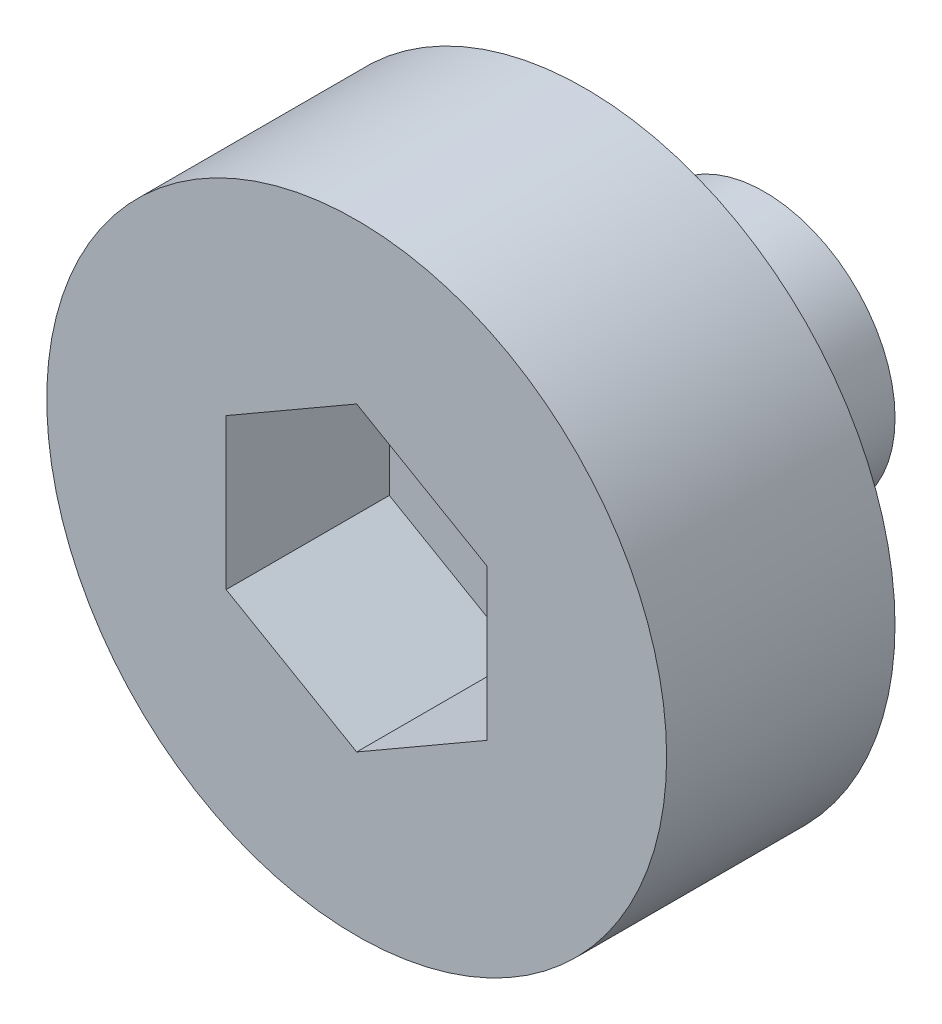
ISO-10303-21;
HEADER;
FILE_DESCRIPTION(('STEP AP214'),'2;1');
FILE_NAME('part.step','',(''),(''),'','','');
FILE_SCHEMA(('AUTOMOTIVE_DESIGN { 1 0 10303 214 1 1 1 1 }'));
ENDSEC;
DATA;
#1=APPLICATION_CONTEXT('core data for automotive mechanical design processes');
#2=APPLICATION_PROTOCOL_DEFINITION('international standard','automotive_design',2000,#1);
#3=PRODUCT_CONTEXT('',#1,'mechanical');
#4=PRODUCT('Part','Part','',(#3));
#5=PRODUCT_RELATED_PRODUCT_CATEGORY('part','',(#4));
#6=PRODUCT_DEFINITION_FORMATION('','',#4);
#7=PRODUCT_DEFINITION_CONTEXT('part definition',#1,'design');
#8=PRODUCT_DEFINITION('design','',#6,#7);
#9=PRODUCT_DEFINITION_SHAPE('','',#8);
#10=(LENGTH_UNIT() NAMED_UNIT(*) SI_UNIT(.MILLI.,.METRE.));
#11=(NAMED_UNIT(*) PLANE_ANGLE_UNIT() SI_UNIT($,.RADIAN.));
#12=(NAMED_UNIT(*) SI_UNIT($,.STERADIAN.) SOLID_ANGLE_UNIT());
#13=UNCERTAINTY_MEASURE_WITH_UNIT(LENGTH_MEASURE(1.E-05),#10,'distance_accuracy_value','');
#14=(GEOMETRIC_REPRESENTATION_CONTEXT(3) GLOBAL_UNCERTAINTY_ASSIGNED_CONTEXT((#13)) GLOBAL_UNIT_ASSIGNED_CONTEXT((#10,
#11,#12)) REPRESENTATION_CONTEXT('',''));
#15=CARTESIAN_POINT('',(0.,0.,0.));
#16=DIRECTION('',(0.,0.,1.));
#17=DIRECTION('',(1.,0.,0.));
#18=AXIS2_PLACEMENT_3D('',#15,#16,#17);
#19=CARTESIAN_POINT('',(0.,0.,11.));
#20=DIRECTION('',(0.,0.,1.));
#21=DIRECTION('',(1.,0.,0.));
#22=AXIS2_PLACEMENT_3D('',#19,#20,#21);
#23=PLANE('',#22);
#24=CARTESIAN_POINT('',(0.,0.,11.));
#25=DIRECTION('',(0.,0.,1.));
#26=DIRECTION('',(1.,0.,0.));
#27=AXIS2_PLACEMENT_3D('',#24,#25,#26);
#28=CIRCLE('',#27,9.5);
#29=CARTESIAN_POINT('',(9.5,0.,11.));
#30=VERTEX_POINT('',#29);
#31=EDGE_CURVE('E228',#30,#30,#28,.T.);
#32=ORIENTED_EDGE('',*,*,#31,.T.);
#33=EDGE_LOOP('',(#32));
#34=FACE_BOUND('',#33,.T.);
#35=DIRECTION('',(0.866025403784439,0.5,0.));
#36=VECTOR('',#35,1.);
#37=CARTESIAN_POINT('',(-2.,3.46410161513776,11.));
#38=LINE('',#37,#36);
#39=CARTESIAN_POINT('',(-4.,2.3094010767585,11.));
#40=VERTEX_POINT('',#39);
#41=CARTESIAN_POINT('',(0.,4.61880215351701,11.));
#42=VERTEX_POINT('',#41);
#43=EDGE_CURVE('E243',#40,#42,#38,.T.);
#44=ORIENTED_EDGE('',*,*,#43,.T.);
#45=DIRECTION('',(0.866025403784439,-0.5,0.));
#46=VECTOR('',#45,1.);
#47=CARTESIAN_POINT('',(2.,3.46410161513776,11.));
#48=LINE('',#47,#46);
#49=CARTESIAN_POINT('',(4.,2.3094010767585,11.));
#50=VERTEX_POINT('',#49);
#51=EDGE_CURVE('E246',#42,#50,#48,.T.);
#52=ORIENTED_EDGE('',*,*,#51,.T.);
#53=DIRECTION('',(0.,-1.,0.));
#54=VECTOR('',#53,1.);
#55=CARTESIAN_POINT('',(4.,0.,11.));
#56=LINE('',#55,#54);
#57=CARTESIAN_POINT('',(4.,-2.3094010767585,11.));
#58=VERTEX_POINT('',#57);
#59=EDGE_CURVE('E231',#50,#58,#56,.T.);
#60=ORIENTED_EDGE('',*,*,#59,.T.);
#61=DIRECTION('',(-0.866025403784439,-0.5,0.));
#62=VECTOR('',#61,1.);
#63=CARTESIAN_POINT('',(2.,-3.46410161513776,11.));
#64=LINE('',#63,#62);
#65=CARTESIAN_POINT('',(0.,-4.618802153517,11.));
#66=VERTEX_POINT('',#65);
#67=EDGE_CURVE('E234',#58,#66,#64,.T.);
#68=ORIENTED_EDGE('',*,*,#67,.T.);
#69=DIRECTION('',(-0.866025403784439,0.5,0.));
#70=VECTOR('',#69,1.);
#71=CARTESIAN_POINT('',(-2.,-3.46410161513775,11.));
#72=LINE('',#71,#70);
#73=CARTESIAN_POINT('',(-4.,-2.3094010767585,11.));
#74=VERTEX_POINT('',#73);
#75=EDGE_CURVE('E237',#66,#74,#72,.T.);
#76=ORIENTED_EDGE('',*,*,#75,.T.);
#77=DIRECTION('',(0.,1.,0.));
#78=VECTOR('',#77,1.);
#79=CARTESIAN_POINT('',(-4.,0.,11.));
#80=LINE('',#79,#78);
#81=EDGE_CURVE('E240',#74,#40,#80,.T.);
#82=ORIENTED_EDGE('',*,*,#81,.T.);
#83=EDGE_LOOP('',(#44,#52,#60,#68,#76,#82));
#84=FACE_BOUND('',#83,.T.);
#85=ADVANCED_FACE('F39',(#34,#84),#23,.T.);
#86=CARTESIAN_POINT('',(0.,0.,11.));
#87=DIRECTION('',(0.,0.,-1.));
#88=DIRECTION('',(-1.,0.,0.));
#89=AXIS2_PLACEMENT_3D('',#86,#87,#88);
#90=CYLINDRICAL_SURFACE('',#89,9.5);
#91=CARTESIAN_POINT('',(0.,0.,4.));
#92=DIRECTION('',(0.,0.,1.));
#93=DIRECTION('',(1.,0.,0.));
#94=AXIS2_PLACEMENT_3D('',#91,#92,#93);
#95=CIRCLE('',#94,9.5);
#96=CARTESIAN_POINT('',(9.5,0.,4.));
#97=VERTEX_POINT('',#96);
#98=EDGE_CURVE('E225',#97,#97,#95,.T.);
#99=ORIENTED_EDGE('',*,*,#98,.T.);
#100=EDGE_LOOP('',(#99));
#101=FACE_BOUND('',#100,.T.);
#102=ORIENTED_EDGE('',*,*,#31,.F.);
#103=EDGE_LOOP('',(#102));
#104=FACE_BOUND('',#103,.T.);
#105=ADVANCED_FACE('F41',(#101,#104),#90,.T.);
#106=CARTESIAN_POINT('',(0.,0.,4.));
#107=DIRECTION('',(0.,0.,1.));
#108=DIRECTION('',(1.,0.,0.));
#109=AXIS2_PLACEMENT_3D('',#106,#107,#108);
#110=PLANE('',#109);
#111=ORIENTED_EDGE('',*,*,#98,.F.);
#112=EDGE_LOOP('',(#111));
#113=FACE_BOUND('',#112,.T.);
#114=CARTESIAN_POINT('',(0.,0.,4.));
#115=DIRECTION('',(0.,0.,1.));
#116=DIRECTION('',(1.,0.,0.));
#117=AXIS2_PLACEMENT_3D('',#114,#115,#116);
#118=CIRCLE('',#117,5.);
#119=CARTESIAN_POINT('',(-5.,0.,4.));
#120=VERTEX_POINT('',#119);
#121=EDGE_CURVE('E224',#120,#120,#118,.T.);
#122=ORIENTED_EDGE('',*,*,#121,.T.);
#123=EDGE_LOOP('',(#122));
#124=FACE_BOUND('',#123,.T.);
#125=ADVANCED_FACE('F278',(#113,#124),#110,.F.);
#126=CARTESIAN_POINT('',(0.,0.,4.));
#127=DIRECTION('',(0.,0.,-1.));
#128=DIRECTION('',(-1.,0.,0.));
#129=AXIS2_PLACEMENT_3D('',#126,#127,#128);
#130=CYLINDRICAL_SURFACE('',#129,5.);
#131=CARTESIAN_POINT('',(-5.,0.,3.04749999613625));
#132=CARTESIAN_POINT('',(-5.,2.07106781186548,2.96812499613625));
#133=CARTESIAN_POINT('',(-3.53553390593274,3.53553390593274,2.88874999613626));
#134=CARTESIAN_POINT('',(-2.07106781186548,5.,2.80937499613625));
#135=CARTESIAN_POINT('',(0.,5.,2.72999999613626));
#136=CARTESIAN_POINT('',(2.07106781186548,5.,2.65062499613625));
#137=CARTESIAN_POINT('',(3.53553390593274,3.53553390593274,2.57124999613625));
#138=CARTESIAN_POINT('',(5.,2.07106781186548,2.49187499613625));
#139=CARTESIAN_POINT('',(5.,0.,2.41249999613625));
#140=CARTESIAN_POINT('',(5.,-2.07106781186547,2.33312499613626));
#141=CARTESIAN_POINT('',(3.53553390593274,-3.53553390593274,2.25374999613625));
#142=CARTESIAN_POINT('',(2.07106781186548,-5.,2.17437499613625));
#143=CARTESIAN_POINT('',(0.,-5.,2.09499999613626));
#144=CARTESIAN_POINT('',(-2.07106781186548,-5.,2.01562499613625));
#145=CARTESIAN_POINT('',(-3.53553390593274,-3.53553390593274,1.93624999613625));
#146=CARTESIAN_POINT('',(-5.,-2.07106781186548,1.85687499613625));
#147=CARTESIAN_POINT('',(-5.,0.,1.77749999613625));
#148=CARTESIAN_POINT('',(-5.,2.07106781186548,1.69812499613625));
#149=CARTESIAN_POINT('',(-3.53553390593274,3.53553390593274,1.61874999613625));
#150=CARTESIAN_POINT('',(-2.07106781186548,5.,1.53937499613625));
#151=CARTESIAN_POINT('',(0.,5.,1.45999999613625));
#152=CARTESIAN_POINT('',(2.07106781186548,5.,1.38062499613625));
#153=CARTESIAN_POINT('',(3.53553390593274,3.53553390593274,1.30124999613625));
#154=CARTESIAN_POINT('',(5.,2.07106781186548,1.22187499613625));
#155=CARTESIAN_POINT('',(5.,0.,1.14249999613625));
#156=CARTESIAN_POINT('',(5.,-2.07106781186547,1.06312499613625));
#157=CARTESIAN_POINT('',(3.53553390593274,-3.53553390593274,0.983749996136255));
#158=CARTESIAN_POINT('',(2.07106781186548,-5.,0.904374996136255));
#159=CARTESIAN_POINT('',(0.,-5.,0.824999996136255));
#160=CARTESIAN_POINT('',(-2.07106781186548,-5.,0.745624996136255));
#161=CARTESIAN_POINT('',(-3.53553390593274,-3.53553390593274,0.666249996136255));
#162=CARTESIAN_POINT('',(-5.,-2.07106781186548,0.586874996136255));
#163=CARTESIAN_POINT('',(-5.,0.,0.507499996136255));
#164=CARTESIAN_POINT('',(-5.,2.07106781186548,0.428124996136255));
#165=CARTESIAN_POINT('',(-3.53553390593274,3.53553390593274,0.348749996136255));
#166=CARTESIAN_POINT('',(-2.07106781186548,5.,0.269374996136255));
#167=CARTESIAN_POINT('',(0.,5.,0.189999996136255));
#168=CARTESIAN_POINT('',(2.07106781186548,5.,0.110624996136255));
#169=CARTESIAN_POINT('',(3.53553390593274,3.53553390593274,0.0312499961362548));
#170=CARTESIAN_POINT('',(5.,2.07106781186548,-0.0481250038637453));
#171=CARTESIAN_POINT('',(5.,0.,-0.127500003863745));
#172=CARTESIAN_POINT('',(5.,-2.07106781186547,-0.206875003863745));
#173=CARTESIAN_POINT('',(3.53553390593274,-3.53553390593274,-0.286250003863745));
#174=CARTESIAN_POINT('',(2.07106781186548,-5.,-0.365625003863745));
#175=CARTESIAN_POINT('',(0.,-5.,-0.445000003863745));
#176=CARTESIAN_POINT('',(-2.07106781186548,-5.,-0.524375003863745));
#177=CARTESIAN_POINT('',(-3.53553390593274,-3.53553390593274,-0.603750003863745));
#178=CARTESIAN_POINT('',(-5.,-2.07106781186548,-0.683125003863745));
#179=CARTESIAN_POINT('',(-5.,0.,-0.762500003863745));
#180=CARTESIAN_POINT('',(-5.,2.07106781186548,-0.841875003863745));
#181=CARTESIAN_POINT('',(-3.53553390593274,3.53553390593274,-0.921250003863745));
#182=CARTESIAN_POINT('',(-2.07106781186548,5.,-1.00062500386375));
#183=CARTESIAN_POINT('',(0.,5.,-1.08000000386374));
#184=CARTESIAN_POINT('',(2.07106781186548,5.,-1.15937500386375));
#185=CARTESIAN_POINT('',(3.53553390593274,3.53553390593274,-1.23875000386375));
#186=CARTESIAN_POINT('',(5.,2.07106781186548,-1.31812500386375));
#187=CARTESIAN_POINT('',(5.,0.,-1.39750000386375));
#188=CARTESIAN_POINT('',(5.,-2.07106781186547,-1.47687500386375));
#189=CARTESIAN_POINT('',(3.53553390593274,-3.53553390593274,-1.55625000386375));
#190=CARTESIAN_POINT('',(2.07106781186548,-5.,-1.63562500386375));
#191=CARTESIAN_POINT('',(0.,-5.,-1.71500000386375));
#192=CARTESIAN_POINT('',(-2.07106781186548,-5.,-1.79437500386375));
#193=CARTESIAN_POINT('',(-3.53553390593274,-3.53553390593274,-1.87375000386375));
#194=CARTESIAN_POINT('',(-4.23311464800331,-2.83795316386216,-1.91155932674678));
#195=CARTESIAN_POINT('',(-4.61345907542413,-1.9276917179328,-1.95248364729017));
#196=(BOUNDED_CURVE() B_SPLINE_CURVE(2,(#131,#132,#133,#134,#135,#136,#137,#138,#139,#140,#141,
#142,#143,#144,#145,#146,#147,#148,#149,#150,#151,#152,#153,#154,#155,#156,#157,#158,#159,#160,
#161,#162,#163,#164,#165,#166,#167,#168,#169,#170,#171,#172,#173,#174,#175,#176,#177,#178,#179,
#180,#181,#182,#183,#184,#185,#186,#187,#188,#189,#190,#191,#192,#193,#194,#195),.UNSPECIFIED.,
.F.,.F.) B_SPLINE_CURVE_WITH_KNOTS((3,2,2,2,2,2,2,2,2,2,2,2,2,2,2,2,2,2,2,2,2,2,2,2,2,2,2,2,2,2,
2,2,3),(0.,0.03125,0.0625,0.09375,0.125,0.15625,0.1875,0.21875,0.25,0.28125,0.3125,0.34375,
0.375,0.40625,0.4375,0.46875,0.5,0.53125,0.5625,0.59375,0.625,0.65625,0.6875,0.71875,0.75,
0.78125,0.8125,0.84375,0.875,0.90625,0.9375,0.96875,0.984253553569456),
.UNSPECIFIED.) CURVE() GEOMETRIC_REPRESENTATION_ITEM() RATIONAL_B_SPLINE_CURVE((1.,
0.923879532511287,1.,0.923879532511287,1.,0.923879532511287,1.,0.923879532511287,1.,
0.923879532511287,1.,0.923879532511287,1.,0.923879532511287,1.,0.923879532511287,1.,
0.923879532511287,1.,0.923879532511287,1.,0.923879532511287,1.,0.923879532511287,1.,
0.923879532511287,1.,0.923879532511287,1.,0.923879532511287,1.,0.923879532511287,1.,
0.923879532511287,1.,0.923879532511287,1.,0.923879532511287,1.,0.923879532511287,1.,
0.923879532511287,1.,0.923879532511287,1.,0.923879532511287,1.,0.923879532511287,1.,
0.923879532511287,1.,0.923879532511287,1.,0.923879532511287,1.,0.923879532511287,1.,
0.923879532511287,1.,0.923879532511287,1.,0.923879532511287,1.,0.962235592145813,0.961942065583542)) REPRESENTATION_ITEM(''));
#197=CARTESIAN_POINT('',(-5.,0.,3.04749999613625));
#198=VERTEX_POINT('',#197);
#199=CARTESIAN_POINT('',(3.81794424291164,-3.2285138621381,0.999999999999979));
#200=VERTEX_POINT('',#199);
#201=EDGE_CURVE('E136',#198,#200,#196,.T.);
#202=ORIENTED_EDGE('',*,*,#201,.T.);
#203=CARTESIAN_POINT('',(0.,0.,0.999999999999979));
#204=DIRECTION('',(0.,0.,1.));
#205=DIRECTION('',(1.,0.,0.));
#206=AXIS2_PLACEMENT_3D('',#203,#204,#205);
#207=CIRCLE('',#206,5.);
#208=CARTESIAN_POINT('',(3.22851393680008,3.81794417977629,0.999999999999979));
#209=VERTEX_POINT('',#208);
#210=EDGE_CURVE('E122',#200,#209,#207,.T.);
#211=ORIENTED_EDGE('',*,*,#210,.T.);
#212=CARTESIAN_POINT('',(-5.,0.,4.));
#213=CARTESIAN_POINT('',(-5.,2.07106781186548,3.920625));
#214=CARTESIAN_POINT('',(-3.53553390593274,3.53553390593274,3.84125));
#215=CARTESIAN_POINT('',(-2.07106781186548,5.,3.761875));
#216=CARTESIAN_POINT('',(0.,5.,3.6825));
#217=CARTESIAN_POINT('',(2.07106781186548,5.,3.603125));
#218=CARTESIAN_POINT('',(3.53553390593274,3.53553390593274,3.52375));
#219=CARTESIAN_POINT('',(5.,2.07106781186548,3.444375));
#220=CARTESIAN_POINT('',(5.,0.,3.365));
#221=CARTESIAN_POINT('',(5.,-2.07106781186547,3.285625));
#222=CARTESIAN_POINT('',(3.53553390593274,-3.53553390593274,3.20625));
#223=CARTESIAN_POINT('',(2.07106781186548,-5.,3.126875));
#224=CARTESIAN_POINT('',(0.,-5.,3.0475));
#225=CARTESIAN_POINT('',(-2.07106781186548,-5.,2.968125));
#226=CARTESIAN_POINT('',(-3.53553390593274,-3.53553390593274,2.88875));
#227=CARTESIAN_POINT('',(-5.,-2.07106781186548,2.809375));
#228=CARTESIAN_POINT('',(-5.,0.,2.73));
#229=CARTESIAN_POINT('',(-5.,2.07106781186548,2.650625));
#230=CARTESIAN_POINT('',(-3.53553390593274,3.53553390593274,2.57125));
#231=CARTESIAN_POINT('',(-2.07106781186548,5.,2.491875));
#232=CARTESIAN_POINT('',(0.,5.,2.4125));
#233=CARTESIAN_POINT('',(2.07106781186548,5.,2.333125));
#234=CARTESIAN_POINT('',(3.53553390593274,3.53553390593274,2.25375));
#235=CARTESIAN_POINT('',(5.,2.07106781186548,2.174375));
#236=CARTESIAN_POINT('',(5.,0.,2.095));
#237=CARTESIAN_POINT('',(5.,-2.07106781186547,2.015625));
#238=CARTESIAN_POINT('',(3.53553390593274,-3.53553390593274,1.93625));
#239=CARTESIAN_POINT('',(2.07106781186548,-5.,1.856875));
#240=CARTESIAN_POINT('',(0.,-5.,1.7775));
#241=CARTESIAN_POINT('',(-2.07106781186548,-5.,1.698125));
#242=CARTESIAN_POINT('',(-3.53553390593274,-3.53553390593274,1.61875));
#243=CARTESIAN_POINT('',(-5.,-2.07106781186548,1.539375));
#244=CARTESIAN_POINT('',(-5.,0.,1.46));
#245=CARTESIAN_POINT('',(-5.,2.07106781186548,1.380625));
#246=CARTESIAN_POINT('',(-3.53553390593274,3.53553390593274,1.30125));
#247=CARTESIAN_POINT('',(-2.07106781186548,5.,1.221875));
#248=CARTESIAN_POINT('',(0.,5.,1.1425));
#249=CARTESIAN_POINT('',(2.07106781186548,5.,1.063125));
#250=CARTESIAN_POINT('',(3.53553390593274,3.53553390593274,0.983749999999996));
#251=CARTESIAN_POINT('',(5.,2.07106781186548,0.904374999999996));
#252=CARTESIAN_POINT('',(5.,0.,0.824999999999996));
#253=CARTESIAN_POINT('',(5.,-2.07106781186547,0.745624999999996));
#254=CARTESIAN_POINT('',(3.53553390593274,-3.53553390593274,0.666249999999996));
#255=CARTESIAN_POINT('',(2.07106781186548,-5.,0.586874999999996));
#256=CARTESIAN_POINT('',(0.,-5.,0.507499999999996));
#257=CARTESIAN_POINT('',(-2.07106781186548,-5.,0.428124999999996));
#258=CARTESIAN_POINT('',(-3.53553390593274,-3.53553390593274,0.348749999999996));
#259=CARTESIAN_POINT('',(-5.,-2.07106781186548,0.269374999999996));
#260=CARTESIAN_POINT('',(-5.,0.,0.189999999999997));
#261=CARTESIAN_POINT('',(-5.,2.07106781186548,0.110624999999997));
#262=CARTESIAN_POINT('',(-3.53553390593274,3.53553390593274,0.0312499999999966));
#263=CARTESIAN_POINT('',(-2.07106781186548,5.,-0.0481250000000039));
#264=CARTESIAN_POINT('',(0.,5.,-0.127500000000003));
#265=CARTESIAN_POINT('',(2.07106781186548,5.,-0.206875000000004));
#266=CARTESIAN_POINT('',(3.53553390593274,3.53553390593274,-0.286250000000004));
#267=CARTESIAN_POINT('',(5.,2.07106781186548,-0.365625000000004));
#268=CARTESIAN_POINT('',(5.,0.,-0.445000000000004));
#269=CARTESIAN_POINT('',(5.,-2.07106781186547,-0.524375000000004));
#270=CARTESIAN_POINT('',(3.53553390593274,-3.53553390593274,-0.603750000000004));
#271=CARTESIAN_POINT('',(2.07106781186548,-5.,-0.683125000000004));
#272=CARTESIAN_POINT('',(0.,-5.,-0.762500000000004));
#273=CARTESIAN_POINT('',(-2.07106781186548,-5.,-0.841875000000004));
#274=CARTESIAN_POINT('',(-3.53553390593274,-3.53553390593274,-0.921250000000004));
#275=CARTESIAN_POINT('',(-4.23311489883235,-2.83795291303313,-0.959059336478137));
#276=CARTESIAN_POINT('',(-4.61345933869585,-1.92769108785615,-0.999983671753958));
#277=(BOUNDED_CURVE() B_SPLINE_CURVE(2,(#212,#213,#214,#215,#216,#217,#218,#219,#220,#221,#222,
#223,#224,#225,#226,#227,#228,#229,#230,#231,#232,#233,#234,#235,#236,#237,#238,#239,#240,#241,
#242,#243,#244,#245,#246,#247,#248,#249,#250,#251,#252,#253,#254,#255,#256,#257,#258,#259,#260,
#261,#262,#263,#264,#265,#266,#267,#268,#269,#270,#271,#272,#273,#274,#275,#276),.UNSPECIFIED.,
.F.,.F.) B_SPLINE_CURVE_WITH_KNOTS((3,2,2,2,2,2,2,2,2,2,2,2,2,2,2,2,2,2,2,2,2,2,2,2,2,2,2,2,2,2,
2,2,3),(0.,0.03125,0.0625,0.09375,0.125,0.15625,0.1875,0.21875,0.25,0.28125,0.3125,0.34375,
0.375,0.40625,0.4375,0.46875,0.5,0.53125,0.5625,0.59375,0.625,0.65625,0.6875,0.71875,0.75,
0.78125,0.8125,0.84375,0.875,0.90625,0.9375,0.96875,0.984253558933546),
.UNSPECIFIED.) CURVE() GEOMETRIC_REPRESENTATION_ITEM() RATIONAL_B_SPLINE_CURVE((1.,
0.923879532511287,1.,0.923879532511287,1.,0.923879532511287,1.,0.923879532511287,1.,
0.923879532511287,1.,0.923879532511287,1.,0.923879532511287,1.,0.923879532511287,1.,
0.923879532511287,1.,0.923879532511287,1.,0.923879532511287,1.,0.923879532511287,1.,
0.923879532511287,1.,0.923879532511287,1.,0.923879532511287,1.,0.923879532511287,1.,
0.923879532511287,1.,0.923879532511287,1.,0.923879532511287,1.,0.923879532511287,1.,
0.923879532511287,1.,0.923879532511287,1.,0.923879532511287,1.,0.923879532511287,1.,
0.923879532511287,1.,0.923879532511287,1.,0.923879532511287,1.,0.923879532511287,1.,
0.923879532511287,1.,0.923879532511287,1.,0.923879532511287,1.,0.96223557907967,0.961942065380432)) REPRESENTATION_ITEM(''));
#278=EDGE_CURVE('E133',#120,#209,#277,.T.);
#279=ORIENTED_EDGE('',*,*,#278,.F.);
#280=ORIENTED_EDGE('',*,*,#121,.F.);
#281=DIRECTION('',(0.,0.,-1.));
#282=VECTOR('',#281,1.);
#283=CARTESIAN_POINT('',(-5.,0.,3.52374999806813));
#284=LINE('',#283,#282);
#285=EDGE_CURVE('E144',#120,#198,#284,.T.);
#286=ORIENTED_EDGE('',*,*,#285,.T.);
#287=EDGE_LOOP('',(#202,#211,#279,#280,#286));
#288=FACE_BOUND('',#287,.T.);
#289=ADVANCED_FACE('F131',(#288),#130,.T.);
#290=CARTESIAN_POINT('',(4.,2.3094010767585,13.));
#291=DIRECTION('',(-0.5,-0.866025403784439,0.));
#292=DIRECTION('',(0.866025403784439,-0.5,0.));
#293=AXIS2_PLACEMENT_3D('',#290,#291,#292);
#294=PLANE('',#293);
#295=DIRECTION('',(-0.866025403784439,0.5,0.));
#296=VECTOR('',#295,1.);
#297=CARTESIAN_POINT('',(4.,2.3094010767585,6.));
#298=LINE('',#297,#296);
#299=CARTESIAN_POINT('',(4.,2.30940107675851,6.));
#300=VERTEX_POINT('',#299);
#301=CARTESIAN_POINT('',(0.,4.61880215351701,6.));
#302=VERTEX_POINT('',#301);
#303=EDGE_CURVE('E206',#300,#302,#298,.T.);
#304=ORIENTED_EDGE('',*,*,#303,.F.);
#305=DIRECTION('',(0.,0.,-1.));
#306=VECTOR('',#305,1.);
#307=CARTESIAN_POINT('',(4.,2.3094010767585,13.));
#308=LINE('',#307,#306);
#309=EDGE_CURVE('E209',#50,#300,#308,.T.);
#310=ORIENTED_EDGE('',*,*,#309,.F.);
#311=ORIENTED_EDGE('',*,*,#51,.F.);
#312=DIRECTION('',(0.,0.,-1.));
#313=VECTOR('',#312,1.);
#314=CARTESIAN_POINT('',(0.,4.61880215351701,13.));
#315=LINE('',#314,#313);
#316=EDGE_CURVE('E222',#42,#302,#315,.T.);
#317=ORIENTED_EDGE('',*,*,#316,.T.);
#318=EDGE_LOOP('',(#304,#310,#311,#317));
#319=FACE_BOUND('',#318,.T.);
#320=ADVANCED_FACE('F287',(#319),#294,.T.);
#321=CARTESIAN_POINT('',(0.,4.61880215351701,13.));
#322=DIRECTION('',(0.5,-0.866025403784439,0.));
#323=DIRECTION('',(0.866025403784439,0.5,0.));
#324=AXIS2_PLACEMENT_3D('',#321,#322,#323);
#325=PLANE('',#324);
#326=DIRECTION('',(-0.866025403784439,-0.5,0.));
#327=VECTOR('',#326,1.);
#328=CARTESIAN_POINT('',(0.,4.61880215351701,6.));
#329=LINE('',#328,#327);
#330=CARTESIAN_POINT('',(-4.,2.3094010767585,6.));
#331=VERTEX_POINT('',#330);
#332=EDGE_CURVE('E66',#302,#331,#329,.T.);
#333=ORIENTED_EDGE('',*,*,#332,.F.);
#334=ORIENTED_EDGE('',*,*,#316,.F.);
#335=ORIENTED_EDGE('',*,*,#43,.F.);
#336=DIRECTION('',(0.,0.,-1.));
#337=VECTOR('',#336,1.);
#338=CARTESIAN_POINT('',(-4.,2.3094010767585,13.));
#339=LINE('',#338,#337);
#340=EDGE_CURVE('E220',#40,#331,#339,.T.);
#341=ORIENTED_EDGE('',*,*,#340,.T.);
#342=EDGE_LOOP('',(#333,#334,#335,#341));
#343=FACE_BOUND('',#342,.T.);
#344=ADVANCED_FACE('F290',(#343),#325,.T.);
#345=CARTESIAN_POINT('',(-4.,2.3094010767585,13.));
#346=DIRECTION('',(1.,0.,0.));
#347=DIRECTION('',(0.,1.,0.));
#348=AXIS2_PLACEMENT_3D('',#345,#346,#347);
#349=PLANE('',#348);
#350=DIRECTION('',(0.,-1.,0.));
#351=VECTOR('',#350,1.);
#352=CARTESIAN_POINT('',(-4.,2.3094010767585,6.));
#353=LINE('',#352,#351);
#354=CARTESIAN_POINT('',(-4.,-2.3094010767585,6.));
#355=VERTEX_POINT('',#354);
#356=EDGE_CURVE('E202',#331,#355,#353,.T.);
#357=ORIENTED_EDGE('',*,*,#356,.F.);
#358=ORIENTED_EDGE('',*,*,#340,.F.);
#359=ORIENTED_EDGE('',*,*,#81,.F.);
#360=DIRECTION('',(0.,0.,-1.));
#361=VECTOR('',#360,1.);
#362=CARTESIAN_POINT('',(-4.,-2.3094010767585,13.));
#363=LINE('',#362,#361);
#364=EDGE_CURVE('E217',#74,#355,#363,.T.);
#365=ORIENTED_EDGE('',*,*,#364,.T.);
#366=EDGE_LOOP('',(#357,#358,#359,#365));
#367=FACE_BOUND('',#366,.T.);
#368=ADVANCED_FACE('F294',(#367),#349,.T.);
#369=CARTESIAN_POINT('',(-4.,-2.3094010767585,13.));
#370=DIRECTION('',(0.5,0.866025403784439,0.));
#371=DIRECTION('',(-0.866025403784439,0.5,0.));
#372=AXIS2_PLACEMENT_3D('',#369,#370,#371);
#373=PLANE('',#372);
#374=DIRECTION('',(0.866025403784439,-0.5,0.));
#375=VECTOR('',#374,1.);
#376=CARTESIAN_POINT('',(-4.,-2.3094010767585,6.));
#377=LINE('',#376,#375);
#378=CARTESIAN_POINT('',(0.,-4.618802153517,6.));
#379=VERTEX_POINT('',#378);
#380=EDGE_CURVE('E199',#355,#379,#377,.T.);
#381=ORIENTED_EDGE('',*,*,#380,.F.);
#382=ORIENTED_EDGE('',*,*,#364,.F.);
#383=ORIENTED_EDGE('',*,*,#75,.F.);
#384=DIRECTION('',(0.,0.,-1.));
#385=VECTOR('',#384,1.);
#386=CARTESIAN_POINT('',(0.,-4.618802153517,13.));
#387=LINE('',#386,#385);
#388=EDGE_CURVE('E214',#66,#379,#387,.T.);
#389=ORIENTED_EDGE('',*,*,#388,.T.);
#390=EDGE_LOOP('',(#381,#382,#383,#389));
#391=FACE_BOUND('',#390,.T.);
#392=ADVANCED_FACE('F297',(#391),#373,.T.);
#393=CARTESIAN_POINT('',(0.,-4.618802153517,13.));
#394=DIRECTION('',(-0.5,0.866025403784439,0.));
#395=DIRECTION('',(-0.866025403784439,-0.5,0.));
#396=AXIS2_PLACEMENT_3D('',#393,#394,#395);
#397=PLANE('',#396);
#398=DIRECTION('',(0.866025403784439,0.5,0.));
#399=VECTOR('',#398,1.);
#400=CARTESIAN_POINT('',(0.,-4.618802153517,6.));
#401=LINE('',#400,#399);
#402=CARTESIAN_POINT('',(4.,-2.3094010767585,6.));
#403=VERTEX_POINT('',#402);
#404=EDGE_CURVE('E195',#379,#403,#401,.T.);
#405=ORIENTED_EDGE('',*,*,#404,.F.);
#406=ORIENTED_EDGE('',*,*,#388,.F.);
#407=ORIENTED_EDGE('',*,*,#67,.F.);
#408=DIRECTION('',(0.,0.,-1.));
#409=VECTOR('',#408,1.);
#410=CARTESIAN_POINT('',(4.,-2.3094010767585,13.));
#411=LINE('',#410,#409);
#412=EDGE_CURVE('E211',#58,#403,#411,.T.);
#413=ORIENTED_EDGE('',*,*,#412,.T.);
#414=EDGE_LOOP('',(#405,#406,#407,#413));
#415=FACE_BOUND('',#414,.T.);
#416=ADVANCED_FACE('F301',(#415),#397,.T.);
#417=CARTESIAN_POINT('',(4.,-2.3094010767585,13.));
#418=DIRECTION('',(-1.,0.,0.));
#419=DIRECTION('',(0.,0.,1.));
#420=AXIS2_PLACEMENT_3D('',#417,#418,#419);
#421=PLANE('',#420);
#422=DIRECTION('',(0.,1.,0.));
#423=VECTOR('',#422,1.);
#424=CARTESIAN_POINT('',(4.,-2.3094010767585,6.));
#425=LINE('',#424,#423);
#426=EDGE_CURVE('E249',#403,#300,#425,.T.);
#427=ORIENTED_EDGE('',*,*,#426,.F.);
#428=ORIENTED_EDGE('',*,*,#412,.F.);
#429=ORIENTED_EDGE('',*,*,#59,.F.);
#430=ORIENTED_EDGE('',*,*,#309,.T.);
#431=EDGE_LOOP('',(#427,#428,#429,#430));
#432=FACE_BOUND('',#431,.T.);
#433=ADVANCED_FACE('F305',(#432),#421,.T.);
#434=CARTESIAN_POINT('',(0.,0.,6.));
#435=DIRECTION('',(0.,0.,1.));
#436=DIRECTION('',(1.,0.,0.));
#437=AXIS2_PLACEMENT_3D('',#434,#435,#436);
#438=PLANE('',#437);
#439=ORIENTED_EDGE('',*,*,#426,.T.);
#440=ORIENTED_EDGE('',*,*,#303,.T.);
#441=ORIENTED_EDGE('',*,*,#332,.T.);
#442=ORIENTED_EDGE('',*,*,#356,.T.);
#443=ORIENTED_EDGE('',*,*,#380,.T.);
#444=ORIENTED_EDGE('',*,*,#404,.T.);
#445=EDGE_LOOP('',(#439,#440,#441,#442,#443,#444));
#446=FACE_BOUND('',#445,.T.);
#447=ADVANCED_FACE('F309',(#446),#438,.T.);
#448=CARTESIAN_POINT('',(-4.3125923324,0.,3.52374999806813));
#449=DIRECTION('',(0.,-1.,0.));
#450=DIRECTION('',(0.,0.,-1.));
#451=AXIS2_PLACEMENT_3D('',#448,#449,#450);
#452=PLANE('',#451);
#453=DIRECTION('',(0.,0.,1.));
#454=VECTOR('',#453,1.);
#455=CARTESIAN_POINT('',(-4.3125923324,0.,3.52374999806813));
#456=LINE('',#455,#454);
#457=CARTESIAN_POINT('',(-4.3125923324,0.,3.44437499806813));
#458=VERTEX_POINT('',#457);
#459=CARTESIAN_POINT('',(-4.3125923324,0.,3.60312499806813));
#460=VERTEX_POINT('',#459);
#461=EDGE_CURVE('E184',#458,#460,#456,.T.);
#462=ORIENTED_EDGE('',*,*,#461,.F.);
#463=DIRECTION('',(0.86602540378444,0.,0.499999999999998));
#464=VECTOR('',#463,1.);
#465=CARTESIAN_POINT('',(-4.6562961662,0.,3.24593749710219));
#466=LINE('',#465,#464);
#467=EDGE_CURVE('E172',#198,#458,#466,.T.);
#468=ORIENTED_EDGE('',*,*,#467,.F.);
#469=ORIENTED_EDGE('',*,*,#285,.F.);
#470=DIRECTION('',(-0.86602540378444,0.,0.499999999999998));
#471=VECTOR('',#470,1.);
#472=CARTESIAN_POINT('',(-4.6562961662,0.,3.80156249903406));
#473=LINE('',#472,#471);
#474=EDGE_CURVE('E140',#460,#120,#473,.T.);
#475=ORIENTED_EDGE('',*,*,#474,.F.);
#476=EDGE_LOOP('',(#462,#468,#469,#475));
#477=FACE_BOUND('',#476,.T.);
#478=ADVANCED_FACE('F313',(#477),#452,.F.);
#479=CARTESIAN_POINT('',(-4.3125923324,0.,3.44437499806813));
#480=CARTESIAN_POINT('',(-4.3125923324,1.7863342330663,3.36499999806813));
#481=CARTESIAN_POINT('',(-3.04946328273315,3.04946328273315,3.28562499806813));
#482=CARTESIAN_POINT('',(-1.7863342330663,4.3125923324,3.20624999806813));
#483=CARTESIAN_POINT('',(0.,4.3125923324,3.12687499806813));
#484=CARTESIAN_POINT('',(1.7863342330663,4.3125923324,3.04749999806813));
#485=CARTESIAN_POINT('',(3.04946328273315,3.04946328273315,2.96812499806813));
#486=CARTESIAN_POINT('',(4.3125923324,1.7863342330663,2.88874999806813));
#487=CARTESIAN_POINT('',(4.3125923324,0.,2.80937499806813));
#488=CARTESIAN_POINT('',(4.3125923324,-1.7863342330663,2.72999999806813));
#489=CARTESIAN_POINT('',(3.04946328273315,-3.04946328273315,2.65062499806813));
#490=CARTESIAN_POINT('',(1.7863342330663,-4.3125923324,2.57124999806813));
#491=CARTESIAN_POINT('',(0.,-4.3125923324,2.49187499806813));
#492=CARTESIAN_POINT('',(-1.7863342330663,-4.3125923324,2.41249999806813));
#493=CARTESIAN_POINT('',(-3.04946328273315,-3.04946328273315,2.33312499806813));
#494=CARTESIAN_POINT('',(-4.3125923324,-1.7863342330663,2.25374999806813));
#495=CARTESIAN_POINT('',(-4.3125923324,0.,2.17437499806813));
#496=CARTESIAN_POINT('',(-4.3125923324,1.7863342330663,2.09499999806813));
#497=CARTESIAN_POINT('',(-3.04946328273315,3.04946328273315,2.01562499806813));
#498=CARTESIAN_POINT('',(-1.7863342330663,4.3125923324,1.93624999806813));
#499=CARTESIAN_POINT('',(0.,4.3125923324,1.85687499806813));
#500=CARTESIAN_POINT('',(1.7863342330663,4.3125923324,1.77749999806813));
#501=CARTESIAN_POINT('',(3.04946328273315,3.04946328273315,1.69812499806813));
#502=CARTESIAN_POINT('',(4.3125923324,1.7863342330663,1.61874999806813));
#503=CARTESIAN_POINT('',(4.3125923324,0.,1.53937499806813));
#504=CARTESIAN_POINT('',(4.3125923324,-1.7863342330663,1.45999999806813));
#505=CARTESIAN_POINT('',(3.04946328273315,-3.04946328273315,1.38062499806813));
#506=CARTESIAN_POINT('',(1.7863342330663,-4.3125923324,1.30124999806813));
#507=CARTESIAN_POINT('',(0.,-4.3125923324,1.22187499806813));
#508=CARTESIAN_POINT('',(-1.7863342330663,-4.3125923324,1.14249999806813));
#509=CARTESIAN_POINT('',(-3.04946328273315,-3.04946328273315,1.06312499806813));
#510=CARTESIAN_POINT('',(-4.3125923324,-1.7863342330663,0.983749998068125));
#511=CARTESIAN_POINT('',(-4.3125923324,0.,0.904374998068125));
#512=CARTESIAN_POINT('',(-4.3125923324,1.7863342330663,0.824999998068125));
#513=CARTESIAN_POINT('',(-3.04946328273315,3.04946328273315,0.745624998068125));
#514=CARTESIAN_POINT('',(-1.7863342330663,4.3125923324,0.666249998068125));
#515=CARTESIAN_POINT('',(0.,4.3125923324,0.586874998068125));
#516=CARTESIAN_POINT('',(1.7863342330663,4.3125923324,0.507499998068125));
#517=CARTESIAN_POINT('',(3.04946328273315,3.04946328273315,0.428124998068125));
#518=CARTESIAN_POINT('',(4.3125923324,1.7863342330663,0.348749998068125));
#519=CARTESIAN_POINT('',(4.3125923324,0.,0.269374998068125));
#520=CARTESIAN_POINT('',(4.3125923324,-1.7863342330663,0.189999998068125));
#521=CARTESIAN_POINT('',(3.04946328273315,-3.04946328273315,0.110624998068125));
#522=CARTESIAN_POINT('',(1.7863342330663,-4.3125923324,0.0312499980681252));
#523=CARTESIAN_POINT('',(0.,-4.3125923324,-0.0481250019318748));
#524=CARTESIAN_POINT('',(-1.7863342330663,-4.3125923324,-0.127500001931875));
#525=CARTESIAN_POINT('',(-3.04946328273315,-3.04946328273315,-0.206875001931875));
#526=CARTESIAN_POINT('',(-4.3125923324,-1.7863342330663,-0.286250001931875));
#527=CARTESIAN_POINT('',(-4.3125923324,0.,-0.365625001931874));
#528=CARTESIAN_POINT('',(-4.3125923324,1.7863342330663,-0.445000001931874));
#529=CARTESIAN_POINT('',(-3.04946328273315,3.04946328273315,-0.524375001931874));
#530=CARTESIAN_POINT('',(-1.7863342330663,4.3125923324,-0.603750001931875));
#531=CARTESIAN_POINT('',(0.,4.3125923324,-0.683125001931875));
#532=CARTESIAN_POINT('',(1.7863342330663,4.3125923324,-0.762500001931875));
#533=CARTESIAN_POINT('',(3.04946328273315,3.04946328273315,-0.841875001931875));
#534=CARTESIAN_POINT('',(4.3125923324,1.7863342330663,-0.921250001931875));
#535=CARTESIAN_POINT('',(4.3125923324,0.,-1.00062500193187));
#536=CARTESIAN_POINT('',(4.3125923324,-1.7863342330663,-1.08000000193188));
#537=CARTESIAN_POINT('',(3.04946328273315,-3.04946328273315,-1.15937500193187));
#538=CARTESIAN_POINT('',(1.7863342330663,-4.3125923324,-1.23875000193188));
#539=CARTESIAN_POINT('',(0.,-4.3125923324,-1.31812500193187));
#540=CARTESIAN_POINT('',(-1.7863342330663,-4.3125923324,-1.39750000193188));
#541=CARTESIAN_POINT('',(-3.04946328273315,-3.04946328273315,-1.47687500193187));
#542=CARTESIAN_POINT('',(-3.65113984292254,-2.44778672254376,-1.51468434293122));
#543=CARTESIAN_POINT('',(-3.97919394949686,-1.6626689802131,-1.55560868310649));
#544=CARTESIAN_POINT('',(-4.3125923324,0.,3.60312499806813));
#545=CARTESIAN_POINT('',(-4.3125923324,1.7863342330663,3.52374999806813));
#546=CARTESIAN_POINT('',(-3.04946328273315,3.04946328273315,3.44437499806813));
#547=CARTESIAN_POINT('',(-1.7863342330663,4.3125923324,3.36499999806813));
#548=CARTESIAN_POINT('',(0.,4.3125923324,3.28562499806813));
#549=CARTESIAN_POINT('',(1.7863342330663,4.3125923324,3.20624999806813));
#550=CARTESIAN_POINT('',(3.04946328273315,3.04946328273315,3.12687499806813));
#551=CARTESIAN_POINT('',(4.3125923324,1.7863342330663,3.04749999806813));
#552=CARTESIAN_POINT('',(4.3125923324,0.,2.96812499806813));
#553=CARTESIAN_POINT('',(4.3125923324,-1.7863342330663,2.88874999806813));
#554=CARTESIAN_POINT('',(3.04946328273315,-3.04946328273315,2.80937499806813));
#555=CARTESIAN_POINT('',(1.7863342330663,-4.3125923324,2.72999999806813));
#556=CARTESIAN_POINT('',(0.,-4.3125923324,2.65062499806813));
#557=CARTESIAN_POINT('',(-1.7863342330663,-4.3125923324,2.57124999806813));
#558=CARTESIAN_POINT('',(-3.04946328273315,-3.04946328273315,2.49187499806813));
#559=CARTESIAN_POINT('',(-4.3125923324,-1.7863342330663,2.41249999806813));
#560=CARTESIAN_POINT('',(-4.3125923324,0.,2.33312499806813));
#561=CARTESIAN_POINT('',(-4.3125923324,1.7863342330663,2.25374999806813));
#562=CARTESIAN_POINT('',(-3.04946328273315,3.04946328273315,2.17437499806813));
#563=CARTESIAN_POINT('',(-1.7863342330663,4.3125923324,2.09499999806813));
#564=CARTESIAN_POINT('',(0.,4.3125923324,2.01562499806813));
#565=CARTESIAN_POINT('',(1.7863342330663,4.3125923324,1.93624999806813));
#566=CARTESIAN_POINT('',(3.04946328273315,3.04946328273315,1.85687499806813));
#567=CARTESIAN_POINT('',(4.3125923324,1.7863342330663,1.77749999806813));
#568=CARTESIAN_POINT('',(4.3125923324,0.,1.69812499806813));
#569=CARTESIAN_POINT('',(4.3125923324,-1.7863342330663,1.61874999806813));
#570=CARTESIAN_POINT('',(3.04946328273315,-3.04946328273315,1.53937499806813));
#571=CARTESIAN_POINT('',(1.7863342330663,-4.3125923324,1.45999999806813));
#572=CARTESIAN_POINT('',(0.,-4.3125923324,1.38062499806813));
#573=CARTESIAN_POINT('',(-1.7863342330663,-4.3125923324,1.30124999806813));
#574=CARTESIAN_POINT('',(-3.04946328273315,-3.04946328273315,1.22187499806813));
#575=CARTESIAN_POINT('',(-4.3125923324,-1.7863342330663,1.14249999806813));
#576=CARTESIAN_POINT('',(-4.3125923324,0.,1.06312499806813));
#577=CARTESIAN_POINT('',(-4.3125923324,1.7863342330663,0.983749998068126));
#578=CARTESIAN_POINT('',(-3.04946328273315,3.04946328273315,0.904374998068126));
#579=CARTESIAN_POINT('',(-1.7863342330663,4.3125923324,0.824999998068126));
#580=CARTESIAN_POINT('',(0.,4.3125923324,0.745624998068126));
#581=CARTESIAN_POINT('',(1.7863342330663,4.3125923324,0.666249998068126));
#582=CARTESIAN_POINT('',(3.04946328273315,3.04946328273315,0.586874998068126));
#583=CARTESIAN_POINT('',(4.3125923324,1.7863342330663,0.507499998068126));
#584=CARTESIAN_POINT('',(4.3125923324,0.,0.428124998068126));
#585=CARTESIAN_POINT('',(4.3125923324,-1.7863342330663,0.348749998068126));
#586=CARTESIAN_POINT('',(3.04946328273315,-3.04946328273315,0.269374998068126));
#587=CARTESIAN_POINT('',(1.7863342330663,-4.3125923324,0.189999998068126));
#588=CARTESIAN_POINT('',(0.,-4.3125923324,0.110624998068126));
#589=CARTESIAN_POINT('',(-1.7863342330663,-4.3125923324,0.0312499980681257));
#590=CARTESIAN_POINT('',(-3.04946328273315,-3.04946328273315,-0.0481250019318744));
#591=CARTESIAN_POINT('',(-4.3125923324,-1.7863342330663,-0.127500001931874));
#592=CARTESIAN_POINT('',(-4.3125923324,0.,-0.206875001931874));
#593=CARTESIAN_POINT('',(-4.3125923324,1.7863342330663,-0.286250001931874));
#594=CARTESIAN_POINT('',(-3.04946328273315,3.04946328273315,-0.365625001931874));
#595=CARTESIAN_POINT('',(-1.7863342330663,4.3125923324,-0.445000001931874));
#596=CARTESIAN_POINT('',(0.,4.3125923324,-0.524375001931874));
#597=CARTESIAN_POINT('',(1.7863342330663,4.3125923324,-0.603750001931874));
#598=CARTESIAN_POINT('',(3.04946328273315,3.04946328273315,-0.683125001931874));
#599=CARTESIAN_POINT('',(4.3125923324,1.7863342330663,-0.762500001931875));
#600=CARTESIAN_POINT('',(4.3125923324,0.,-0.841875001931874));
#601=CARTESIAN_POINT('',(4.3125923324,-1.7863342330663,-0.921250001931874));
#602=CARTESIAN_POINT('',(3.04946328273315,-3.04946328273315,-1.00062500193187));
#603=CARTESIAN_POINT('',(1.7863342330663,-4.3125923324,-1.08000000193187));
#604=CARTESIAN_POINT('',(0.,-4.3125923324,-1.15937500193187));
#605=CARTESIAN_POINT('',(-1.7863342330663,-4.3125923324,-1.23875000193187));
#606=CARTESIAN_POINT('',(-3.04946328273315,-3.04946328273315,-1.31812500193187));
#607=CARTESIAN_POINT('',(-3.65113984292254,-2.44778672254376,-1.35593434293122));
#608=CARTESIAN_POINT('',(-3.97919394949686,-1.6626689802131,-1.39685868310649));
#609=(BOUNDED_SURFACE() B_SPLINE_SURFACE(1,2,((#479,#480,#481,#482,#483,#484,#485,#486,#487,
#488,#489,#490,#491,#492,#493,#494,#495,#496,#497,#498,#499,#500,#501,#502,#503,#504,#505,#506,
#507,#508,#509,#510,#511,#512,#513,#514,#515,#516,#517,#518,#519,#520,#521,#522,#523,#524,#525,
#526,#527,#528,#529,#530,#531,#532,#533,#534,#535,#536,#537,#538,#539,#540,#541,#542,#543),
(#544,#545,#546,#547,#548,#549,#550,#551,#552,#553,#554,#555,#556,#557,#558,#559,#560,#561,#562,
#563,#564,#565,#566,#567,#568,#569,#570,#571,#572,#573,#574,#575,#576,#577,#578,#579,#580,#581,
#582,#583,#584,#585,#586,#587,#588,#589,#590,#591,#592,#593,#594,#595,#596,#597,#598,#599,#600,
#601,#602,#603,#604,#605,#606,#607,#608)),.UNSPECIFIED.,.F.,.F.,
.F.) B_SPLINE_SURFACE_WITH_KNOTS((2,2),(3,2,2,2,2,2,2,2,2,2,2,2,2,2,2,2,2,2,2,2,2,2,2,2,2,2,2,2,
2,2,2,2,3),(0.,1.),(0.,0.03125,0.0625,0.09375,0.125,0.15625,0.1875,0.21875,0.25,0.28125,0.3125,
0.34375,0.375,0.40625,0.4375,0.46875,0.5,0.53125,0.5625,0.59375,0.625,0.65625,0.6875,0.71875,
0.75,0.78125,0.8125,0.84375,0.875,0.90625,0.9375,0.96875,0.984253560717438),
.UNSPECIFIED.) GEOMETRIC_REPRESENTATION_ITEM() RATIONAL_B_SPLINE_SURFACE(((1.,0.923879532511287,
1.,0.923879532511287,1.,0.923879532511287,1.,0.923879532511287,1.,0.923879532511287,1.,
0.923879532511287,1.,0.923879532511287,1.,0.923879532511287,1.,0.923879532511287,1.,
0.923879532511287,1.,0.923879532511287,1.,0.923879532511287,1.,0.923879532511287,1.,
0.923879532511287,1.,0.923879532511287,1.,0.923879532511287,1.,0.923879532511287,1.,
0.923879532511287,1.,0.923879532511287,1.,0.923879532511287,1.,0.923879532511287,1.,
0.923879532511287,1.,0.923879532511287,1.,0.923879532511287,1.,0.923879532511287,1.,
0.923879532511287,1.,0.923879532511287,1.,0.923879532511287,1.,0.923879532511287,1.,
0.923879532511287,1.,0.923879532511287,1.,0.962235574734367,0.961942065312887),(1.,
0.923879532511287,1.,0.923879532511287,1.,0.923879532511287,1.,0.923879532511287,1.,
0.923879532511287,1.,0.923879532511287,1.,0.923879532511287,1.,0.923879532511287,1.,
0.923879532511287,1.,0.923879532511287,1.,0.923879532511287,1.,0.923879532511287,1.,
0.923879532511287,1.,0.923879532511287,1.,0.923879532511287,1.,0.923879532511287,1.,
0.923879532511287,1.,0.923879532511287,1.,0.923879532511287,1.,0.923879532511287,1.,
0.923879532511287,1.,0.923879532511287,1.,0.923879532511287,1.,0.923879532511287,1.,
0.923879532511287,1.,0.923879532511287,1.,0.923879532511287,1.,0.923879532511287,1.,
0.923879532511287,1.,0.923879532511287,1.,0.923879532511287,1.,0.962235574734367,0.961942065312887))) REPRESENTATION_ITEM('') SURFACE());
#610=CARTESIAN_POINT('',(-3.8427726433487,-1.95743481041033,0.999999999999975));
#611=CARTESIAN_POINT('',(-3.89085358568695,-1.86308707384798,0.999999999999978));
#612=CARTESIAN_POINT('',(-3.93544874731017,-1.76691839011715,0.999999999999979));
#613=CARTESIAN_POINT('',(-4.05863252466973,-1.47339662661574,0.99999999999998));
#614=CARTESIAN_POINT('',(-4.12639175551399,-1.2714042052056,0.999999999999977));
#615=CARTESIAN_POINT('',(-4.23139190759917,-0.859619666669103,0.999999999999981));
#616=CARTESIAN_POINT('',(-4.26863282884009,-0.649827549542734,0.999999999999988));
#617=CARTESIAN_POINT('',(-4.30103870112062,-0.332903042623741,0.999999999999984));
#618=CARTESIAN_POINT('',(-4.3079300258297,-0.226858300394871,0.99999999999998));
#619=CARTESIAN_POINT('',(-4.313876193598,-0.0145293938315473,0.999999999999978));
#620=CARTESIAN_POINT('',(-4.31292926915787,0.0917548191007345,0.999999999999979));
#621=CARTESIAN_POINT('',(-4.29920230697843,0.390328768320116,0.99999999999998));
#622=CARTESIAN_POINT('',(-4.27742998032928,0.582308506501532,0.999999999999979));
#623=CARTESIAN_POINT('',(-4.22568095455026,0.86685390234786,0.999999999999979));
#624=CARTESIAN_POINT('',(-4.2052056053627,0.961267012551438,0.999999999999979));
#625=CARTESIAN_POINT('',(-4.15797263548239,1.14848657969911,0.999999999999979));
#626=CARTESIAN_POINT('',(-4.1312163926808,1.24129338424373,0.999999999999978));
#627=CARTESIAN_POINT('',(-4.10136602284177,1.33313516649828,0.999999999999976));
#628=B_SPLINE_CURVE_WITH_KNOTS('',3,(#610,#611,#612,#613,#614,#615,#616,#617,#618,#619,#620,
#621,#622,#623,#624,#625,#626,#627),.UNSPECIFIED.,.F.,.F.,(4,2,2,2,2,2,2,2,4),(0.,
0.317715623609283,0.954453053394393,1.59119048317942,1.9097406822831,2.22836271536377,
2.80595808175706,3.09560288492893,3.38518420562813),.UNSPECIFIED.);
#629=CARTESIAN_POINT('',(-3.8427726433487,-1.95743481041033,0.999999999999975));
#630=VERTEX_POINT('',#629);
#631=CARTESIAN_POINT('',(-4.10136602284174,1.33313516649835,0.999999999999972));
#632=VERTEX_POINT('',#631);
#633=EDGE_CURVE('E58',#630,#632,#628,.T.);
#634=CARTESIAN_POINT('',(-4.3125923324,0.,3.44437499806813));
#635=CARTESIAN_POINT('',(-4.3125923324,1.7863342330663,3.36499999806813));
#636=CARTESIAN_POINT('',(-3.04946328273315,3.04946328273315,3.28562499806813));
#637=CARTESIAN_POINT('',(-1.7863342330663,4.3125923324,3.20624999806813));
#638=CARTESIAN_POINT('',(0.,4.3125923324,3.12687499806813));
#639=CARTESIAN_POINT('',(1.7863342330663,4.3125923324,3.04749999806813));
#640=CARTESIAN_POINT('',(3.04946328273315,3.04946328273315,2.96812499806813));
#641=CARTESIAN_POINT('',(4.3125923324,1.7863342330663,2.88874999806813));
#642=CARTESIAN_POINT('',(4.3125923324,0.,2.80937499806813));
#643=CARTESIAN_POINT('',(4.3125923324,-1.7863342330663,2.72999999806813));
#644=CARTESIAN_POINT('',(3.04946328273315,-3.04946328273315,2.65062499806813));
#645=CARTESIAN_POINT('',(1.7863342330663,-4.3125923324,2.57124999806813));
#646=CARTESIAN_POINT('',(0.,-4.3125923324,2.49187499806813));
#647=CARTESIAN_POINT('',(-1.7863342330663,-4.3125923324,2.41249999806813));
#648=CARTESIAN_POINT('',(-3.04946328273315,-3.04946328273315,2.33312499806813));
#649=CARTESIAN_POINT('',(-4.3125923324,-1.7863342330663,2.25374999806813));
#650=CARTESIAN_POINT('',(-4.3125923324,0.,2.17437499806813));
#651=CARTESIAN_POINT('',(-4.3125923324,1.7863342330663,2.09499999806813));
#652=CARTESIAN_POINT('',(-3.04946328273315,3.04946328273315,2.01562499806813));
#653=CARTESIAN_POINT('',(-1.7863342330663,4.3125923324,1.93624999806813));
#654=CARTESIAN_POINT('',(0.,4.3125923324,1.85687499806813));
#655=CARTESIAN_POINT('',(1.7863342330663,4.3125923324,1.77749999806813));
#656=CARTESIAN_POINT('',(3.04946328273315,3.04946328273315,1.69812499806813));
#657=CARTESIAN_POINT('',(4.3125923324,1.7863342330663,1.61874999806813));
#658=CARTESIAN_POINT('',(4.3125923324,0.,1.53937499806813));
#659=CARTESIAN_POINT('',(4.3125923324,-1.7863342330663,1.45999999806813));
#660=CARTESIAN_POINT('',(3.04946328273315,-3.04946328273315,1.38062499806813));
#661=CARTESIAN_POINT('',(1.7863342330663,-4.3125923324,1.30124999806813));
#662=CARTESIAN_POINT('',(0.,-4.3125923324,1.22187499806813));
#663=CARTESIAN_POINT('',(-1.7863342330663,-4.3125923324,1.14249999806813));
#664=CARTESIAN_POINT('',(-3.04946328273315,-3.04946328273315,1.06312499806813));
#665=CARTESIAN_POINT('',(-4.3125923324,-1.7863342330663,0.983749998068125));
#666=CARTESIAN_POINT('',(-4.3125923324,0.,0.904374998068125));
#667=CARTESIAN_POINT('',(-4.3125923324,1.7863342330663,0.824999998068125));
#668=CARTESIAN_POINT('',(-3.04946328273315,3.04946328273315,0.745624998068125));
#669=CARTESIAN_POINT('',(-1.7863342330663,4.3125923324,0.666249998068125));
#670=CARTESIAN_POINT('',(0.,4.3125923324,0.586874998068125));
#671=CARTESIAN_POINT('',(1.7863342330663,4.3125923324,0.507499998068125));
#672=CARTESIAN_POINT('',(3.04946328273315,3.04946328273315,0.428124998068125));
#673=CARTESIAN_POINT('',(4.3125923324,1.7863342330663,0.348749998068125));
#674=CARTESIAN_POINT('',(4.3125923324,0.,0.269374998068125));
#675=CARTESIAN_POINT('',(4.3125923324,-1.7863342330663,0.189999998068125));
#676=CARTESIAN_POINT('',(3.04946328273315,-3.04946328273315,0.110624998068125));
#677=CARTESIAN_POINT('',(1.7863342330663,-4.3125923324,0.0312499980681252));
#678=CARTESIAN_POINT('',(0.,-4.3125923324,-0.0481250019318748));
#679=CARTESIAN_POINT('',(-1.7863342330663,-4.3125923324,-0.127500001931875));
#680=CARTESIAN_POINT('',(-3.04946328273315,-3.04946328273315,-0.206875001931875));
#681=CARTESIAN_POINT('',(-4.3125923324,-1.7863342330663,-0.286250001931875));
#682=CARTESIAN_POINT('',(-4.3125923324,0.,-0.365625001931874));
#683=CARTESIAN_POINT('',(-4.3125923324,1.7863342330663,-0.445000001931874));
#684=CARTESIAN_POINT('',(-3.04946328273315,3.04946328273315,-0.524375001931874));
#685=CARTESIAN_POINT('',(-1.7863342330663,4.3125923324,-0.603750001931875));
#686=CARTESIAN_POINT('',(0.,4.3125923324,-0.683125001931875));
#687=CARTESIAN_POINT('',(1.7863342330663,4.3125923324,-0.762500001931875));
#688=CARTESIAN_POINT('',(3.04946328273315,3.04946328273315,-0.841875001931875));
#689=CARTESIAN_POINT('',(4.3125923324,1.7863342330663,-0.921250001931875));
#690=CARTESIAN_POINT('',(4.3125923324,0.,-1.00062500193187));
#691=CARTESIAN_POINT('',(4.3125923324,-1.7863342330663,-1.08000000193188));
#692=CARTESIAN_POINT('',(3.04946328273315,-3.04946328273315,-1.15937500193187));
#693=CARTESIAN_POINT('',(1.7863342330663,-4.3125923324,-1.23875000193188));
#694=CARTESIAN_POINT('',(0.,-4.3125923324,-1.31812500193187));
#695=CARTESIAN_POINT('',(-1.7863342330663,-4.3125923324,-1.39750000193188));
#696=CARTESIAN_POINT('',(-3.04946328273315,-3.04946328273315,-1.47687500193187));
#697=CARTESIAN_POINT('',(-3.6511397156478,-2.4477868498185,-1.51468433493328));
#698=CARTESIAN_POINT('',(-3.97919381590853,-1.66266929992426,-1.55560866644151));
#699=(BOUNDED_CURVE() B_SPLINE_CURVE(2,(#634,#635,#636,#637,#638,#639,#640,#641,#642,#643,#644,
#645,#646,#647,#648,#649,#650,#651,#652,#653,#654,#655,#656,#657,#658,#659,#660,#661,#662,#663,
#664,#665,#666,#667,#668,#669,#670,#671,#672,#673,#674,#675,#676,#677,#678,#679,#680,#681,#682,
#683,#684,#685,#686,#687,#688,#689,#690,#691,#692,#693,#694,#695,#696,#697,#698),.UNSPECIFIED.,
.F.,.F.) B_SPLINE_CURVE_WITH_KNOTS((3,2,2,2,2,2,2,2,2,2,2,2,2,2,2,2,2,2,2,2,2,2,2,2,2,2,2,2,2,2,
2,2,3),(0.,0.03125,0.0625,0.09375,0.125,0.15625,0.1875,0.21875,0.25,0.28125,0.3125,0.34375,
0.375,0.40625,0.4375,0.46875,0.5,0.53125,0.5625,0.59375,0.625,0.65625,0.6875,0.71875,0.75,
0.78125,0.8125,0.84375,0.875,0.90625,0.9375,0.96875,0.984253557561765),
.UNSPECIFIED.) CURVE() GEOMETRIC_REPRESENTATION_ITEM() RATIONAL_B_SPLINE_CURVE((1.,
0.923879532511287,1.,0.923879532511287,1.,0.923879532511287,1.,0.923879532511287,1.,
0.923879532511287,1.,0.923879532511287,1.,0.923879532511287,1.,0.923879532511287,1.,
0.923879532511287,1.,0.923879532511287,1.,0.923879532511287,1.,0.923879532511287,1.,
0.923879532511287,1.,0.923879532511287,1.,0.923879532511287,1.,0.923879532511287,1.,
0.923879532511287,1.,0.923879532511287,1.,0.923879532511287,1.,0.923879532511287,1.,
0.923879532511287,1.,0.923879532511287,1.,0.923879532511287,1.,0.923879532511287,1.,
0.923879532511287,1.,0.923879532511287,1.,0.923879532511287,1.,0.923879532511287,1.,
0.923879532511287,1.,0.923879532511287,1.,0.923879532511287,1.,0.962235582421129,0.961942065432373)) REPRESENTATION_ITEM(''));
#700=EDGE_CURVE('E177',#458,#630,#699,.T.);
#701=CARTESIAN_POINT('',(-4.3125923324,0.,3.60312499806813));
#702=CARTESIAN_POINT('',(-4.3125923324,1.7863342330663,3.52374999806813));
#703=CARTESIAN_POINT('',(-3.04946328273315,3.04946328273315,3.44437499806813));
#704=CARTESIAN_POINT('',(-1.7863342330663,4.3125923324,3.36499999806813));
#705=CARTESIAN_POINT('',(0.,4.3125923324,3.28562499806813));
#706=CARTESIAN_POINT('',(1.7863342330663,4.3125923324,3.20624999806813));
#707=CARTESIAN_POINT('',(3.04946328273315,3.04946328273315,3.12687499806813));
#708=CARTESIAN_POINT('',(4.3125923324,1.7863342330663,3.04749999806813));
#709=CARTESIAN_POINT('',(4.3125923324,0.,2.96812499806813));
#710=CARTESIAN_POINT('',(4.3125923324,-1.7863342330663,2.88874999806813));
#711=CARTESIAN_POINT('',(3.04946328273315,-3.04946328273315,2.80937499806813));
#712=CARTESIAN_POINT('',(1.7863342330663,-4.3125923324,2.72999999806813));
#713=CARTESIAN_POINT('',(0.,-4.3125923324,2.65062499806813));
#714=CARTESIAN_POINT('',(-1.7863342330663,-4.3125923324,2.57124999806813));
#715=CARTESIAN_POINT('',(-3.04946328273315,-3.04946328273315,2.49187499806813));
#716=CARTESIAN_POINT('',(-4.3125923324,-1.7863342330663,2.41249999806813));
#717=CARTESIAN_POINT('',(-4.3125923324,0.,2.33312499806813));
#718=CARTESIAN_POINT('',(-4.3125923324,1.7863342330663,2.25374999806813));
#719=CARTESIAN_POINT('',(-3.04946328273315,3.04946328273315,2.17437499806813));
#720=CARTESIAN_POINT('',(-1.7863342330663,4.3125923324,2.09499999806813));
#721=CARTESIAN_POINT('',(0.,4.3125923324,2.01562499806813));
#722=CARTESIAN_POINT('',(1.7863342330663,4.3125923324,1.93624999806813));
#723=CARTESIAN_POINT('',(3.04946328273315,3.04946328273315,1.85687499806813));
#724=CARTESIAN_POINT('',(4.3125923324,1.7863342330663,1.77749999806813));
#725=CARTESIAN_POINT('',(4.3125923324,0.,1.69812499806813));
#726=CARTESIAN_POINT('',(4.3125923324,-1.7863342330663,1.61874999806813));
#727=CARTESIAN_POINT('',(3.04946328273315,-3.04946328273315,1.53937499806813));
#728=CARTESIAN_POINT('',(1.7863342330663,-4.3125923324,1.45999999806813));
#729=CARTESIAN_POINT('',(0.,-4.3125923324,1.38062499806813));
#730=CARTESIAN_POINT('',(-1.7863342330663,-4.3125923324,1.30124999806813));
#731=CARTESIAN_POINT('',(-3.04946328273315,-3.04946328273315,1.22187499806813));
#732=CARTESIAN_POINT('',(-4.3125923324,-1.7863342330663,1.14249999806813));
#733=CARTESIAN_POINT('',(-4.3125923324,0.,1.06312499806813));
#734=CARTESIAN_POINT('',(-4.3125923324,1.7863342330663,0.983749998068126));
#735=CARTESIAN_POINT('',(-3.04946328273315,3.04946328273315,0.904374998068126));
#736=CARTESIAN_POINT('',(-1.7863342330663,4.3125923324,0.824999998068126));
#737=CARTESIAN_POINT('',(0.,4.3125923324,0.745624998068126));
#738=CARTESIAN_POINT('',(1.7863342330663,4.3125923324,0.666249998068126));
#739=CARTESIAN_POINT('',(3.04946328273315,3.04946328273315,0.586874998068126));
#740=CARTESIAN_POINT('',(4.3125923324,1.7863342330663,0.507499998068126));
#741=CARTESIAN_POINT('',(4.3125923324,0.,0.428124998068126));
#742=CARTESIAN_POINT('',(4.3125923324,-1.7863342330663,0.348749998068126));
#743=CARTESIAN_POINT('',(3.04946328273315,-3.04946328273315,0.269374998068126));
#744=CARTESIAN_POINT('',(1.7863342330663,-4.3125923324,0.189999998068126));
#745=CARTESIAN_POINT('',(0.,-4.3125923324,0.110624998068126));
#746=CARTESIAN_POINT('',(-1.7863342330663,-4.3125923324,0.0312499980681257));
#747=CARTESIAN_POINT('',(-3.04946328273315,-3.04946328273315,-0.0481250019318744));
#748=CARTESIAN_POINT('',(-4.3125923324,-1.7863342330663,-0.127500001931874));
#749=CARTESIAN_POINT('',(-4.3125923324,0.,-0.206875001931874));
#750=CARTESIAN_POINT('',(-4.3125923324,1.7863342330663,-0.286250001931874));
#751=CARTESIAN_POINT('',(-3.04946328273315,3.04946328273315,-0.365625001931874));
#752=CARTESIAN_POINT('',(-1.7863342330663,4.3125923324,-0.445000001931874));
#753=CARTESIAN_POINT('',(0.,4.3125923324,-0.524375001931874));
#754=CARTESIAN_POINT('',(1.7863342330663,4.3125923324,-0.603750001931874));
#755=CARTESIAN_POINT('',(3.04946328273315,3.04946328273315,-0.683125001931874));
#756=CARTESIAN_POINT('',(4.3125923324,1.7863342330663,-0.762500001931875));
#757=CARTESIAN_POINT('',(4.3125923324,0.,-0.841875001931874));
#758=CARTESIAN_POINT('',(4.3125923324,-1.7863342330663,-0.921250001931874));
#759=CARTESIAN_POINT('',(3.04946328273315,-3.04946328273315,-1.00062500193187));
#760=CARTESIAN_POINT('',(1.7863342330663,-4.3125923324,-1.08000000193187));
#761=CARTESIAN_POINT('',(0.,-4.3125923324,-1.15937500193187));
#762=CARTESIAN_POINT('',(-1.7863342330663,-4.3125923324,-1.23875000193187));
#763=CARTESIAN_POINT('',(-3.04946328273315,-3.04946328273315,-1.31812500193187));
#764=CARTESIAN_POINT('',(-3.65113984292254,-2.44778672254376,-1.35593434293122));
#765=CARTESIAN_POINT('',(-3.97919394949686,-1.6626689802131,-1.39685868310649));
#766=(BOUNDED_CURVE() B_SPLINE_CURVE(2,(#701,#702,#703,#704,#705,#706,#707,#708,#709,#710,#711,
#712,#713,#714,#715,#716,#717,#718,#719,#720,#721,#722,#723,#724,#725,#726,#727,#728,#729,#730,
#731,#732,#733,#734,#735,#736,#737,#738,#739,#740,#741,#742,#743,#744,#745,#746,#747,#748,#749,
#750,#751,#752,#753,#754,#755,#756,#757,#758,#759,#760,#761,#762,#763,#764,#765),.UNSPECIFIED.,
.F.,.F.) B_SPLINE_CURVE_WITH_KNOTS((3,2,2,2,2,2,2,2,2,2,2,2,2,2,2,2,2,2,2,2,2,2,2,2,2,2,2,2,2,2,
2,2,3),(0.,0.03125,0.0625,0.09375,0.125,0.15625,0.1875,0.21875,0.25,0.28125,0.3125,0.34375,
0.375,0.40625,0.4375,0.46875,0.5,0.53125,0.5625,0.59375,0.625,0.65625,0.6875,0.71875,0.75,
0.78125,0.8125,0.84375,0.875,0.90625,0.9375,0.96875,0.984253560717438),
.UNSPECIFIED.) CURVE() GEOMETRIC_REPRESENTATION_ITEM() RATIONAL_B_SPLINE_CURVE((1.,
0.923879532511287,1.,0.923879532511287,1.,0.923879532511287,1.,0.923879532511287,1.,
0.923879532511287,1.,0.923879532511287,1.,0.923879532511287,1.,0.923879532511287,1.,
0.923879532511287,1.,0.923879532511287,1.,0.923879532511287,1.,0.923879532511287,1.,
0.923879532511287,1.,0.923879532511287,1.,0.923879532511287,1.,0.923879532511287,1.,
0.923879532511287,1.,0.923879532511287,1.,0.923879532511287,1.,0.923879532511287,1.,
0.923879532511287,1.,0.923879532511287,1.,0.923879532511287,1.,0.923879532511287,1.,
0.923879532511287,1.,0.923879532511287,1.,0.923879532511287,1.,0.923879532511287,1.,
0.923879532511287,1.,0.923879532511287,1.,0.923879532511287,1.,0.962235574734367,0.961942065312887)) REPRESENTATION_ITEM(''));
#767=EDGE_CURVE('E142',#460,#632,#766,.T.);
#768=ORIENTED_EDGE('',*,*,#633,.F.);
#769=ORIENTED_EDGE('',*,*,#700,.F.);
#770=ORIENTED_EDGE('',*,*,#461,.T.);
#771=ORIENTED_EDGE('',*,*,#767,.T.);
#772=EDGE_LOOP('',(#768,#769,#770,#771));
#773=FACE_BOUND('',#772,.T.);
#774=ADVANCED_FACE('F317',(#773),#609,.T.);
#775=CARTESIAN_POINT('',(-5.,0.,3.04749999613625));
#776=CARTESIAN_POINT('',(-5.,2.07106781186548,2.96812499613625));
#777=CARTESIAN_POINT('',(-3.53553390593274,3.53553390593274,2.88874999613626));
#778=CARTESIAN_POINT('',(-2.07106781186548,5.,2.80937499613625));
#779=CARTESIAN_POINT('',(0.,5.,2.72999999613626));
#780=CARTESIAN_POINT('',(2.07106781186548,5.,2.65062499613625));
#781=CARTESIAN_POINT('',(3.53553390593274,3.53553390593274,2.57124999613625));
#782=CARTESIAN_POINT('',(5.,2.07106781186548,2.49187499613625));
#783=CARTESIAN_POINT('',(5.,0.,2.41249999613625));
#784=CARTESIAN_POINT('',(5.,-2.07106781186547,2.33312499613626));
#785=CARTESIAN_POINT('',(3.53553390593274,-3.53553390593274,2.25374999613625));
#786=CARTESIAN_POINT('',(2.07106781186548,-5.,2.17437499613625));
#787=CARTESIAN_POINT('',(0.,-5.,2.09499999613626));
#788=CARTESIAN_POINT('',(-2.07106781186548,-5.,2.01562499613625));
#789=CARTESIAN_POINT('',(-3.53553390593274,-3.53553390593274,1.93624999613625));
#790=CARTESIAN_POINT('',(-5.,-2.07106781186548,1.85687499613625));
#791=CARTESIAN_POINT('',(-5.,0.,1.77749999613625));
#792=CARTESIAN_POINT('',(-5.,2.07106781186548,1.69812499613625));
#793=CARTESIAN_POINT('',(-3.53553390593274,3.53553390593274,1.61874999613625));
#794=CARTESIAN_POINT('',(-2.07106781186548,5.,1.53937499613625));
#795=CARTESIAN_POINT('',(0.,5.,1.45999999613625));
#796=CARTESIAN_POINT('',(2.07106781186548,5.,1.38062499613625));
#797=CARTESIAN_POINT('',(3.53553390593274,3.53553390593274,1.30124999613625));
#798=CARTESIAN_POINT('',(5.,2.07106781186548,1.22187499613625));
#799=CARTESIAN_POINT('',(5.,0.,1.14249999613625));
#800=CARTESIAN_POINT('',(5.,-2.07106781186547,1.06312499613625));
#801=CARTESIAN_POINT('',(3.53553390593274,-3.53553390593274,0.983749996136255));
#802=CARTESIAN_POINT('',(2.07106781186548,-5.,0.904374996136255));
#803=CARTESIAN_POINT('',(0.,-5.,0.824999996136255));
#804=CARTESIAN_POINT('',(-2.07106781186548,-5.,0.745624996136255));
#805=CARTESIAN_POINT('',(-3.53553390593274,-3.53553390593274,0.666249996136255));
#806=CARTESIAN_POINT('',(-5.,-2.07106781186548,0.586874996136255));
#807=CARTESIAN_POINT('',(-5.,0.,0.507499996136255));
#808=CARTESIAN_POINT('',(-5.,2.07106781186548,0.428124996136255));
#809=CARTESIAN_POINT('',(-3.53553390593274,3.53553390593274,0.348749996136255));
#810=CARTESIAN_POINT('',(-2.07106781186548,5.,0.269374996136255));
#811=CARTESIAN_POINT('',(0.,5.,0.189999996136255));
#812=CARTESIAN_POINT('',(2.07106781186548,5.,0.110624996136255));
#813=CARTESIAN_POINT('',(3.53553390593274,3.53553390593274,0.0312499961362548));
#814=CARTESIAN_POINT('',(5.,2.07106781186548,-0.0481250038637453));
#815=CARTESIAN_POINT('',(5.,0.,-0.127500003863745));
#816=CARTESIAN_POINT('',(5.,-2.07106781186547,-0.206875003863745));
#817=CARTESIAN_POINT('',(3.53553390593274,-3.53553390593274,-0.286250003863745));
#818=CARTESIAN_POINT('',(2.07106781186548,-5.,-0.365625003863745));
#819=CARTESIAN_POINT('',(0.,-5.,-0.445000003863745));
#820=CARTESIAN_POINT('',(-2.07106781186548,-5.,-0.524375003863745));
#821=CARTESIAN_POINT('',(-3.53553390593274,-3.53553390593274,-0.603750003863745));
#822=CARTESIAN_POINT('',(-5.,-2.07106781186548,-0.683125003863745));
#823=CARTESIAN_POINT('',(-5.,0.,-0.762500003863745));
#824=CARTESIAN_POINT('',(-5.,2.07106781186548,-0.841875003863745));
#825=CARTESIAN_POINT('',(-3.53553390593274,3.53553390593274,-0.921250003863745));
#826=CARTESIAN_POINT('',(-2.07106781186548,5.,-1.00062500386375));
#827=CARTESIAN_POINT('',(0.,5.,-1.08000000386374));
#828=CARTESIAN_POINT('',(2.07106781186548,5.,-1.15937500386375));
#829=CARTESIAN_POINT('',(3.53553390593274,3.53553390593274,-1.23875000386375));
#830=CARTESIAN_POINT('',(5.,2.07106781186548,-1.31812500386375));
#831=CARTESIAN_POINT('',(5.,0.,-1.39750000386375));
#832=CARTESIAN_POINT('',(5.,-2.07106781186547,-1.47687500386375));
#833=CARTESIAN_POINT('',(3.53553390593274,-3.53553390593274,-1.55625000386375));
#834=CARTESIAN_POINT('',(2.07106781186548,-5.,-1.63562500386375));
#835=CARTESIAN_POINT('',(0.,-5.,-1.71500000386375));
#836=CARTESIAN_POINT('',(-2.07106781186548,-5.,-1.79437500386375));
#837=CARTESIAN_POINT('',(-3.53553390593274,-3.53553390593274,-1.87375000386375));
#838=CARTESIAN_POINT('',(-4.23311483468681,-2.83795297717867,-1.91155933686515));
#839=CARTESIAN_POINT('',(-4.6134592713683,-1.92769124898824,-1.95248366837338));
#840=CARTESIAN_POINT('',(-4.3125923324,0.,3.44437499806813));
#841=CARTESIAN_POINT('',(-4.3125923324,1.7863342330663,3.36499999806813));
#842=CARTESIAN_POINT('',(-3.04946328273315,3.04946328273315,3.28562499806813));
#843=CARTESIAN_POINT('',(-1.7863342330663,4.3125923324,3.20624999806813));
#844=CARTESIAN_POINT('',(0.,4.3125923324,3.12687499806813));
#845=CARTESIAN_POINT('',(1.7863342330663,4.3125923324,3.04749999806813));
#846=CARTESIAN_POINT('',(3.04946328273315,3.04946328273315,2.96812499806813));
#847=CARTESIAN_POINT('',(4.3125923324,1.7863342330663,2.88874999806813));
#848=CARTESIAN_POINT('',(4.3125923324,0.,2.80937499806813));
#849=CARTESIAN_POINT('',(4.3125923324,-1.7863342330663,2.72999999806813));
#850=CARTESIAN_POINT('',(3.04946328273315,-3.04946328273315,2.65062499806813));
#851=CARTESIAN_POINT('',(1.7863342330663,-4.3125923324,2.57124999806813));
#852=CARTESIAN_POINT('',(0.,-4.3125923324,2.49187499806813));
#853=CARTESIAN_POINT('',(-1.7863342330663,-4.3125923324,2.41249999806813));
#854=CARTESIAN_POINT('',(-3.04946328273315,-3.04946328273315,2.33312499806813));
#855=CARTESIAN_POINT('',(-4.3125923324,-1.7863342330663,2.25374999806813));
#856=CARTESIAN_POINT('',(-4.3125923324,0.,2.17437499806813));
#857=CARTESIAN_POINT('',(-4.3125923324,1.7863342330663,2.09499999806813));
#858=CARTESIAN_POINT('',(-3.04946328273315,3.04946328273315,2.01562499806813));
#859=CARTESIAN_POINT('',(-1.7863342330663,4.3125923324,1.93624999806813));
#860=CARTESIAN_POINT('',(0.,4.3125923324,1.85687499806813));
#861=CARTESIAN_POINT('',(1.7863342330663,4.3125923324,1.77749999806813));
#862=CARTESIAN_POINT('',(3.04946328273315,3.04946328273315,1.69812499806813));
#863=CARTESIAN_POINT('',(4.3125923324,1.7863342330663,1.61874999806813));
#864=CARTESIAN_POINT('',(4.3125923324,0.,1.53937499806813));
#865=CARTESIAN_POINT('',(4.3125923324,-1.7863342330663,1.45999999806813));
#866=CARTESIAN_POINT('',(3.04946328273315,-3.04946328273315,1.38062499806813));
#867=CARTESIAN_POINT('',(1.7863342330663,-4.3125923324,1.30124999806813));
#868=CARTESIAN_POINT('',(0.,-4.3125923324,1.22187499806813));
#869=CARTESIAN_POINT('',(-1.7863342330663,-4.3125923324,1.14249999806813));
#870=CARTESIAN_POINT('',(-3.04946328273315,-3.04946328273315,1.06312499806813));
#871=CARTESIAN_POINT('',(-4.3125923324,-1.7863342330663,0.983749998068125));
#872=CARTESIAN_POINT('',(-4.3125923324,0.,0.904374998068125));
#873=CARTESIAN_POINT('',(-4.3125923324,1.7863342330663,0.824999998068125));
#874=CARTESIAN_POINT('',(-3.04946328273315,3.04946328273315,0.745624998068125));
#875=CARTESIAN_POINT('',(-1.7863342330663,4.3125923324,0.666249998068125));
#876=CARTESIAN_POINT('',(0.,4.3125923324,0.586874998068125));
#877=CARTESIAN_POINT('',(1.7863342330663,4.3125923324,0.507499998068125));
#878=CARTESIAN_POINT('',(3.04946328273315,3.04946328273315,0.428124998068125));
#879=CARTESIAN_POINT('',(4.3125923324,1.7863342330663,0.348749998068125));
#880=CARTESIAN_POINT('',(4.3125923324,0.,0.269374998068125));
#881=CARTESIAN_POINT('',(4.3125923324,-1.7863342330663,0.189999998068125));
#882=CARTESIAN_POINT('',(3.04946328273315,-3.04946328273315,0.110624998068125));
#883=CARTESIAN_POINT('',(1.7863342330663,-4.3125923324,0.0312499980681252));
#884=CARTESIAN_POINT('',(0.,-4.3125923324,-0.0481250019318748));
#885=CARTESIAN_POINT('',(-1.7863342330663,-4.3125923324,-0.127500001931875));
#886=CARTESIAN_POINT('',(-3.04946328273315,-3.04946328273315,-0.206875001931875));
#887=CARTESIAN_POINT('',(-4.3125923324,-1.7863342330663,-0.286250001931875));
#888=CARTESIAN_POINT('',(-4.3125923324,0.,-0.365625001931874));
#889=CARTESIAN_POINT('',(-4.3125923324,1.7863342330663,-0.445000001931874));
#890=CARTESIAN_POINT('',(-3.04946328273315,3.04946328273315,-0.524375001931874));
#891=CARTESIAN_POINT('',(-1.7863342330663,4.3125923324,-0.603750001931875));
#892=CARTESIAN_POINT('',(0.,4.3125923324,-0.683125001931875));
#893=CARTESIAN_POINT('',(1.7863342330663,4.3125923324,-0.762500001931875));
#894=CARTESIAN_POINT('',(3.04946328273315,3.04946328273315,-0.841875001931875));
#895=CARTESIAN_POINT('',(4.3125923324,1.7863342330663,-0.921250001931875));
#896=CARTESIAN_POINT('',(4.3125923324,0.,-1.00062500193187));
#897=CARTESIAN_POINT('',(4.3125923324,-1.7863342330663,-1.08000000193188));
#898=CARTESIAN_POINT('',(3.04946328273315,-3.04946328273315,-1.15937500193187));
#899=CARTESIAN_POINT('',(1.7863342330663,-4.3125923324,-1.23875000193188));
#900=CARTESIAN_POINT('',(0.,-4.3125923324,-1.31812500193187));
#901=CARTESIAN_POINT('',(-1.7863342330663,-4.3125923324,-1.39750000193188));
#902=CARTESIAN_POINT('',(-3.04946328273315,-3.04946328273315,-1.47687500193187));
#903=CARTESIAN_POINT('',(-3.6511397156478,-2.4477868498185,-1.51468433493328));
#904=CARTESIAN_POINT('',(-3.97919381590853,-1.66266929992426,-1.55560866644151));
#905=(BOUNDED_SURFACE() B_SPLINE_SURFACE(1,2,((#775,#776,#777,#778,#779,#780,#781,#782,#783,
#784,#785,#786,#787,#788,#789,#790,#791,#792,#793,#794,#795,#796,#797,#798,#799,#800,#801,#802,
#803,#804,#805,#806,#807,#808,#809,#810,#811,#812,#813,#814,#815,#816,#817,#818,#819,#820,#821,
#822,#823,#824,#825,#826,#827,#828,#829,#830,#831,#832,#833,#834,#835,#836,#837,#838,#839),
(#840,#841,#842,#843,#844,#845,#846,#847,#848,#849,#850,#851,#852,#853,#854,#855,#856,#857,#858,
#859,#860,#861,#862,#863,#864,#865,#866,#867,#868,#869,#870,#871,#872,#873,#874,#875,#876,#877,
#878,#879,#880,#881,#882,#883,#884,#885,#886,#887,#888,#889,#890,#891,#892,#893,#894,#895,#896,
#897,#898,#899,#900,#901,#902,#903,#904)),.UNSPECIFIED.,.F.,.F.,
.F.) B_SPLINE_SURFACE_WITH_KNOTS((2,2),(3,2,2,2,2,2,2,2,2,2,2,2,2,2,2,2,2,2,2,2,2,2,2,2,2,2,2,2,
2,2,2,2,3),(0.,1.),(0.,0.03125,0.0625,0.09375,0.125,0.15625,0.1875,0.21875,0.25,0.28125,0.3125,
0.34375,0.375,0.40625,0.4375,0.46875,0.5,0.53125,0.5625,0.59375,0.625,0.65625,0.6875,0.71875,
0.75,0.78125,0.8125,0.84375,0.875,0.90625,0.9375,0.96875,0.984253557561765),
.UNSPECIFIED.) GEOMETRIC_REPRESENTATION_ITEM() RATIONAL_B_SPLINE_SURFACE(((1.,0.923879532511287,
1.,0.923879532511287,1.,0.923879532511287,1.,0.923879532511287,1.,0.923879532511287,1.,
0.923879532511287,1.,0.923879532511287,1.,0.923879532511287,1.,0.923879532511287,1.,
0.923879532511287,1.,0.923879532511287,1.,0.923879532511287,1.,0.923879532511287,1.,
0.923879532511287,1.,0.923879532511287,1.,0.923879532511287,1.,0.923879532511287,1.,
0.923879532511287,1.,0.923879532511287,1.,0.923879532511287,1.,0.923879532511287,1.,
0.923879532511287,1.,0.923879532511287,1.,0.923879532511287,1.,0.923879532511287,1.,
0.923879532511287,1.,0.923879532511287,1.,0.923879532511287,1.,0.923879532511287,1.,
0.923879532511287,1.,0.923879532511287,1.,0.962235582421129,0.961942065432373),(1.,
0.923879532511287,1.,0.923879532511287,1.,0.923879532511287,1.,0.923879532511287,1.,
0.923879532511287,1.,0.923879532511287,1.,0.923879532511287,1.,0.923879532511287,1.,
0.923879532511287,1.,0.923879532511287,1.,0.923879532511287,1.,0.923879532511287,1.,
0.923879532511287,1.,0.923879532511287,1.,0.923879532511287,1.,0.923879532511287,1.,
0.923879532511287,1.,0.923879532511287,1.,0.923879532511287,1.,0.923879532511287,1.,
0.923879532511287,1.,0.923879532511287,1.,0.923879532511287,1.,0.923879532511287,1.,
0.923879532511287,1.,0.923879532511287,1.,0.923879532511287,1.,0.923879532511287,1.,
0.923879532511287,1.,0.923879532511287,1.,0.923879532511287,1.,0.962235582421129,0.961942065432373))) REPRESENTATION_ITEM('') SURFACE());
#906=CARTESIAN_POINT('',(3.81794424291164,-3.2285138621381,0.999999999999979));
#907=CARTESIAN_POINT('',(3.76935508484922,-3.27855926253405,0.999999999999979));
#908=CARTESIAN_POINT('',(3.71976361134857,-3.32763500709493,0.999999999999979));
#909=CARTESIAN_POINT('',(3.6186064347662,-3.42371459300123,0.999999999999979));
#910=CARTESIAN_POINT('',(3.56704058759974,-3.47071828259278,0.999999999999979));
#911=CARTESIAN_POINT('',(3.46197017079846,-3.56251556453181,0.999999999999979));
#912=CARTESIAN_POINT('',(3.40846552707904,-3.60730907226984,0.999999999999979));
#913=CARTESIAN_POINT('',(3.29955651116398,-3.69451465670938,0.999999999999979));
#914=CARTESIAN_POINT('',(3.24415216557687,-3.73692676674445,0.999999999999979));
#915=CARTESIAN_POINT('',(3.07540067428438,-3.86040091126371,0.999999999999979));
#916=CARTESIAN_POINT('',(2.95936320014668,-3.93783345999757,0.999999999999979));
#917=CARTESIAN_POINT('',(2.72104110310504,-4.08234665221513,0.999999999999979));
#918=CARTESIAN_POINT('',(2.5987567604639,-4.14942775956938,0.999999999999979));
#919=CARTESIAN_POINT('',(2.34866253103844,-4.27284097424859,0.999999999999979));
#920=CARTESIAN_POINT('',(2.22084522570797,-4.32915806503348,0.999999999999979));
#921=CARTESIAN_POINT('',(1.96080951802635,-4.43049563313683,0.999999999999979));
#922=CARTESIAN_POINT('',(1.82859110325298,-4.47551607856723,0.999999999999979));
#923=CARTESIAN_POINT('',(1.5607213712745,-4.5539284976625,0.999999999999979));
#924=CARTESIAN_POINT('',(1.42506941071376,-4.5873182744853,0.999999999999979));
#925=CARTESIAN_POINT('',(1.15138512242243,-4.64220531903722,0.999999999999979));
#926=CARTESIAN_POINT('',(1.01335280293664,-4.66370262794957,0.999999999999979));
#927=CARTESIAN_POINT('',(0.739796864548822,-4.69421342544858,0.999999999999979));
#928=CARTESIAN_POINT('',(0.604310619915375,-4.7035583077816,0.999999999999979));
#929=CARTESIAN_POINT('',(0.400888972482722,-4.70898603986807,0.999999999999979));
#930=CARTESIAN_POINT('',(0.333042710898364,-4.70936328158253,0.999999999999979));
#931=CARTESIAN_POINT('',(0.19738978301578,-4.70725984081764,0.999999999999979));
#932=CARTESIAN_POINT('',(0.129583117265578,-4.70477911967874,0.999999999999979));
#933=CARTESIAN_POINT('',(-0.00583385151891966,-4.69694921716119,0.999999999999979));
#934=CARTESIAN_POINT('',(-0.0734442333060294,-4.69160141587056,0.999999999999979));
#935=CARTESIAN_POINT('',(-0.208349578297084,-4.67786403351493,0.999999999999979));
#936=CARTESIAN_POINT('',(-0.275644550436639,-4.6694745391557,0.999999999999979));
#937=CARTESIAN_POINT('',(-0.476852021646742,-4.63981532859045,0.999999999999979));
#938=CARTESIAN_POINT('',(-0.610131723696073,-4.61405232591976,0.999999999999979));
#939=CARTESIAN_POINT('',(-0.870485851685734,-4.55152973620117,0.999999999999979));
#940=CARTESIAN_POINT('',(-0.99763191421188,-4.51506588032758,0.999999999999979));
#941=CARTESIAN_POINT('',(-1.24828209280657,-4.4312026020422,0.999999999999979));
#942=CARTESIAN_POINT('',(-1.37178593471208,-4.38380235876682,0.999999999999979));
#943=CARTESIAN_POINT('',(-1.614254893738,-4.27839748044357,0.999999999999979));
#944=CARTESIAN_POINT('',(-1.73321768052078,-4.22038748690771,0.999999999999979));
#945=CARTESIAN_POINT('',(-1.9656340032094,-4.09421970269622,0.999999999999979));
#946=CARTESIAN_POINT('',(-2.07908761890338,-4.026062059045,0.999999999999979));
#947=CARTESIAN_POINT('',(-2.29601711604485,-3.88250210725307,0.999999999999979));
#948=CARTESIAN_POINT('',(-2.39969785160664,-3.80740910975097,0.999999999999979));
#949=CARTESIAN_POINT('',(-2.60037531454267,-3.6487420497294,0.999999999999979));
#950=CARTESIAN_POINT('',(-2.69737105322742,-3.56516673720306,0.999999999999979));
#951=CARTESIAN_POINT('',(-2.88386092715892,-3.39021959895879,0.999999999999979));
#952=CARTESIAN_POINT('',(-2.97336368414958,-3.29885698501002,0.999999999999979));
#953=CARTESIAN_POINT('',(-3.10160957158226,-3.15646928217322,0.999999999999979));
#954=CARTESIAN_POINT('',(-3.14335360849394,-3.10812032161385,0.999999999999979));
#955=CARTESIAN_POINT('',(-3.22463074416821,-3.0095970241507,0.999999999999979));
#956=CARTESIAN_POINT('',(-3.26416360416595,-2.95942249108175,0.999999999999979));
#957=CARTESIAN_POINT('',(-3.41237638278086,-2.76236807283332,0.999999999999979));
#958=CARTESIAN_POINT('',(-3.51292556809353,-2.60917278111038,0.999999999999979));
#959=CARTESIAN_POINT('',(-3.64834892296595,-2.3708249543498,0.999999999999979));
#960=CARTESIAN_POINT('',(-3.69093489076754,-2.28992156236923,0.99999999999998));
#961=CARTESIAN_POINT('',(-3.77083854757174,-2.12553902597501,0.999999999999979));
#962=CARTESIAN_POINT('',(-3.80815546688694,-2.04205950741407,0.999999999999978));
#963=CARTESIAN_POINT('',(-3.8427726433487,-1.95743481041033,0.999999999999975));
#964=B_SPLINE_CURVE_WITH_KNOTS('',3,(#906,#907,#908,#909,#910,#911,#912,#913,#914,#915,#916,
#917,#918,#919,#920,#921,#922,#923,#924,#925,#926,#927,#928,#929,#930,#931,#932,#933,#934,#935,
#936,#937,#938,#939,#940,#941,#942,#943,#944,#945,#946,#947,#948,#949,#950,#951,#952,#953,#954,
#955,#956,#957,#958,#959,#960,#961,#962,#963),.UNSPECIFIED.,.F.,.F.,(4,2,2,2,2,2,2,2,2,2,2,2,2,
2,2,2,2,2,2,2,2,2,2,2,2,2,2,2,4),(0.,0.209247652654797,0.418510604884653,0.627781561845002,
0.837049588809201,1.25498263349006,1.67289694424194,2.09139008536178,2.50988440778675,
2.92845773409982,3.34702961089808,3.75392967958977,3.95742164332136,4.16091635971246,
4.36431321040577,4.56770426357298,4.97435268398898,5.37067895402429,5.76703498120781,
6.16359174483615,6.56014276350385,6.94374250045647,7.32739884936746,7.71060749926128,
7.90218000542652,8.09377315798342,8.64167148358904,8.91580285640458,9.18997423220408),.UNSPECIFIED.);
#965=EDGE_CURVE('E146',#200,#630,#964,.T.);
#966=ORIENTED_EDGE('',*,*,#965,.F.);
#967=ORIENTED_EDGE('',*,*,#201,.F.);
#968=ORIENTED_EDGE('',*,*,#467,.T.);
#969=ORIENTED_EDGE('',*,*,#700,.T.);
#970=EDGE_LOOP('',(#966,#967,#968,#969));
#971=FACE_BOUND('',#970,.T.);
#972=ADVANCED_FACE('F323',(#971),#905,.T.);
#973=CARTESIAN_POINT('',(-4.3125923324,0.,3.60312499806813));
#974=CARTESIAN_POINT('',(-4.3125923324,1.7863342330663,3.52374999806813));
#975=CARTESIAN_POINT('',(-3.04946328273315,3.04946328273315,3.44437499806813));
#976=CARTESIAN_POINT('',(-1.7863342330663,4.3125923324,3.36499999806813));
#977=CARTESIAN_POINT('',(0.,4.3125923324,3.28562499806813));
#978=CARTESIAN_POINT('',(1.7863342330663,4.3125923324,3.20624999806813));
#979=CARTESIAN_POINT('',(3.04946328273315,3.04946328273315,3.12687499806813));
#980=CARTESIAN_POINT('',(4.3125923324,1.7863342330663,3.04749999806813));
#981=CARTESIAN_POINT('',(4.3125923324,0.,2.96812499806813));
#982=CARTESIAN_POINT('',(4.3125923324,-1.7863342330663,2.88874999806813));
#983=CARTESIAN_POINT('',(3.04946328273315,-3.04946328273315,2.80937499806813));
#984=CARTESIAN_POINT('',(1.7863342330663,-4.3125923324,2.72999999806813));
#985=CARTESIAN_POINT('',(0.,-4.3125923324,2.65062499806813));
#986=CARTESIAN_POINT('',(-1.7863342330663,-4.3125923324,2.57124999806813));
#987=CARTESIAN_POINT('',(-3.04946328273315,-3.04946328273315,2.49187499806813));
#988=CARTESIAN_POINT('',(-4.3125923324,-1.7863342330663,2.41249999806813));
#989=CARTESIAN_POINT('',(-4.3125923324,0.,2.33312499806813));
#990=CARTESIAN_POINT('',(-4.3125923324,1.7863342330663,2.25374999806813));
#991=CARTESIAN_POINT('',(-3.04946328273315,3.04946328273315,2.17437499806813));
#992=CARTESIAN_POINT('',(-1.7863342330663,4.3125923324,2.09499999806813));
#993=CARTESIAN_POINT('',(0.,4.3125923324,2.01562499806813));
#994=CARTESIAN_POINT('',(1.7863342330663,4.3125923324,1.93624999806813));
#995=CARTESIAN_POINT('',(3.04946328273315,3.04946328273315,1.85687499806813));
#996=CARTESIAN_POINT('',(4.3125923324,1.7863342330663,1.77749999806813));
#997=CARTESIAN_POINT('',(4.3125923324,0.,1.69812499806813));
#998=CARTESIAN_POINT('',(4.3125923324,-1.7863342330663,1.61874999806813));
#999=CARTESIAN_POINT('',(3.04946328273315,-3.04946328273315,1.53937499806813));
#1000=CARTESIAN_POINT('',(1.7863342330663,-4.3125923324,1.45999999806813));
#1001=CARTESIAN_POINT('',(0.,-4.3125923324,1.38062499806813));
#1002=CARTESIAN_POINT('',(-1.7863342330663,-4.3125923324,1.30124999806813));
#1003=CARTESIAN_POINT('',(-3.04946328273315,-3.04946328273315,1.22187499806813));
#1004=CARTESIAN_POINT('',(-4.3125923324,-1.7863342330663,1.14249999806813));
#1005=CARTESIAN_POINT('',(-4.3125923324,0.,1.06312499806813));
#1006=CARTESIAN_POINT('',(-4.3125923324,1.7863342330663,0.983749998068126));
#1007=CARTESIAN_POINT('',(-3.04946328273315,3.04946328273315,0.904374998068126));
#1008=CARTESIAN_POINT('',(-1.7863342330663,4.3125923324,0.824999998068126));
#1009=CARTESIAN_POINT('',(0.,4.3125923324,0.745624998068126));
#1010=CARTESIAN_POINT('',(1.7863342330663,4.3125923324,0.666249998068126));
#1011=CARTESIAN_POINT('',(3.04946328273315,3.04946328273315,0.586874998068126));
#1012=CARTESIAN_POINT('',(4.3125923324,1.7863342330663,0.507499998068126));
#1013=CARTESIAN_POINT('',(4.3125923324,0.,0.428124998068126));
#1014=CARTESIAN_POINT('',(4.3125923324,-1.7863342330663,0.348749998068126));
#1015=CARTESIAN_POINT('',(3.04946328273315,-3.04946328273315,0.269374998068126));
#1016=CARTESIAN_POINT('',(1.7863342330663,-4.3125923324,0.189999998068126));
#1017=CARTESIAN_POINT('',(0.,-4.3125923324,0.110624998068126));
#1018=CARTESIAN_POINT('',(-1.7863342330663,-4.3125923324,0.0312499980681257));
#1019=CARTESIAN_POINT('',(-3.04946328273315,-3.04946328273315,-0.0481250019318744));
#1020=CARTESIAN_POINT('',(-4.3125923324,-1.7863342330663,-0.127500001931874));
#1021=CARTESIAN_POINT('',(-4.3125923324,0.,-0.206875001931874));
#1022=CARTESIAN_POINT('',(-4.3125923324,1.7863342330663,-0.286250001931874));
#1023=CARTESIAN_POINT('',(-3.04946328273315,3.04946328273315,-0.365625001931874));
#1024=CARTESIAN_POINT('',(-1.7863342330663,4.3125923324,-0.445000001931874));
#1025=CARTESIAN_POINT('',(0.,4.3125923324,-0.524375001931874));
#1026=CARTESIAN_POINT('',(1.7863342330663,4.3125923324,-0.603750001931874));
#1027=CARTESIAN_POINT('',(3.04946328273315,3.04946328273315,-0.683125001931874));
#1028=CARTESIAN_POINT('',(4.3125923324,1.7863342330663,-0.762500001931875));
#1029=CARTESIAN_POINT('',(4.3125923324,0.,-0.841875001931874));
#1030=CARTESIAN_POINT('',(4.3125923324,-1.7863342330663,-0.921250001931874));
#1031=CARTESIAN_POINT('',(3.04946328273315,-3.04946328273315,-1.00062500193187));
#1032=CARTESIAN_POINT('',(1.7863342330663,-4.3125923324,-1.08000000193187));
#1033=CARTESIAN_POINT('',(0.,-4.3125923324,-1.15937500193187));
#1034=CARTESIAN_POINT('',(-1.7863342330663,-4.3125923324,-1.23875000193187));
#1035=CARTESIAN_POINT('',(-3.04946328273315,-3.04946328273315,-1.31812500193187));
#1036=CARTESIAN_POINT('',(-3.65113977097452,-2.44778679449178,-1.35593433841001));
#1037=CARTESIAN_POINT('',(-3.97919387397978,-1.66266916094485,-1.39685867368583));
#1038=CARTESIAN_POINT('',(-5.,0.,4.));
#1039=CARTESIAN_POINT('',(-5.,2.07106781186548,3.920625));
#1040=CARTESIAN_POINT('',(-3.53553390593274,3.53553390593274,3.84125));
#1041=CARTESIAN_POINT('',(-2.07106781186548,5.,3.761875));
#1042=CARTESIAN_POINT('',(0.,5.,3.6825));
#1043=CARTESIAN_POINT('',(2.07106781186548,5.,3.603125));
#1044=CARTESIAN_POINT('',(3.53553390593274,3.53553390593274,3.52375));
#1045=CARTESIAN_POINT('',(5.,2.07106781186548,3.444375));
#1046=CARTESIAN_POINT('',(5.,0.,3.365));
#1047=CARTESIAN_POINT('',(5.,-2.07106781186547,3.285625));
#1048=CARTESIAN_POINT('',(3.53553390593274,-3.53553390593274,3.20625));
#1049=CARTESIAN_POINT('',(2.07106781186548,-5.,3.126875));
#1050=CARTESIAN_POINT('',(0.,-5.,3.0475));
#1051=CARTESIAN_POINT('',(-2.07106781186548,-5.,2.968125));
#1052=CARTESIAN_POINT('',(-3.53553390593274,-3.53553390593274,2.88875));
#1053=CARTESIAN_POINT('',(-5.,-2.07106781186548,2.809375));
#1054=CARTESIAN_POINT('',(-5.,0.,2.73));
#1055=CARTESIAN_POINT('',(-5.,2.07106781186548,2.650625));
#1056=CARTESIAN_POINT('',(-3.53553390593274,3.53553390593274,2.57125));
#1057=CARTESIAN_POINT('',(-2.07106781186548,5.,2.491875));
#1058=CARTESIAN_POINT('',(0.,5.,2.4125));
#1059=CARTESIAN_POINT('',(2.07106781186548,5.,2.333125));
#1060=CARTESIAN_POINT('',(3.53553390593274,3.53553390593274,2.25375));
#1061=CARTESIAN_POINT('',(5.,2.07106781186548,2.174375));
#1062=CARTESIAN_POINT('',(5.,0.,2.095));
#1063=CARTESIAN_POINT('',(5.,-2.07106781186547,2.015625));
#1064=CARTESIAN_POINT('',(3.53553390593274,-3.53553390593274,1.93625));
#1065=CARTESIAN_POINT('',(2.07106781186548,-5.,1.856875));
#1066=CARTESIAN_POINT('',(0.,-5.,1.7775));
#1067=CARTESIAN_POINT('',(-2.07106781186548,-5.,1.698125));
#1068=CARTESIAN_POINT('',(-3.53553390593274,-3.53553390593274,1.61875));
#1069=CARTESIAN_POINT('',(-5.,-2.07106781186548,1.539375));
#1070=CARTESIAN_POINT('',(-5.,0.,1.46));
#1071=CARTESIAN_POINT('',(-5.,2.07106781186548,1.380625));
#1072=CARTESIAN_POINT('',(-3.53553390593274,3.53553390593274,1.30125));
#1073=CARTESIAN_POINT('',(-2.07106781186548,5.,1.221875));
#1074=CARTESIAN_POINT('',(0.,5.,1.1425));
#1075=CARTESIAN_POINT('',(2.07106781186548,5.,1.063125));
#1076=CARTESIAN_POINT('',(3.53553390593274,3.53553390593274,0.983749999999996));
#1077=CARTESIAN_POINT('',(5.,2.07106781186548,0.904374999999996));
#1078=CARTESIAN_POINT('',(5.,0.,0.824999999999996));
#1079=CARTESIAN_POINT('',(5.,-2.07106781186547,0.745624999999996));
#1080=CARTESIAN_POINT('',(3.53553390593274,-3.53553390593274,0.666249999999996));
#1081=CARTESIAN_POINT('',(2.07106781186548,-5.,0.586874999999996));
#1082=CARTESIAN_POINT('',(0.,-5.,0.507499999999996));
#1083=CARTESIAN_POINT('',(-2.07106781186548,-5.,0.428124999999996));
#1084=CARTESIAN_POINT('',(-3.53553390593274,-3.53553390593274,0.348749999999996));
#1085=CARTESIAN_POINT('',(-5.,-2.07106781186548,0.269374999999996));
#1086=CARTESIAN_POINT('',(-5.,0.,0.189999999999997));
#1087=CARTESIAN_POINT('',(-5.,2.07106781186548,0.110624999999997));
#1088=CARTESIAN_POINT('',(-3.53553390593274,3.53553390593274,0.0312499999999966));
#1089=CARTESIAN_POINT('',(-2.07106781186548,5.,-0.0481250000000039));
#1090=CARTESIAN_POINT('',(0.,5.,-0.127500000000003));
#1091=CARTESIAN_POINT('',(2.07106781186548,5.,-0.206875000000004));
#1092=CARTESIAN_POINT('',(3.53553390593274,3.53553390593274,-0.286250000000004));
#1093=CARTESIAN_POINT('',(5.,2.07106781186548,-0.365625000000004));
#1094=CARTESIAN_POINT('',(5.,0.,-0.445000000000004));
#1095=CARTESIAN_POINT('',(5.,-2.07106781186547,-0.524375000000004));
#1096=CARTESIAN_POINT('',(3.53553390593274,-3.53553390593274,-0.603750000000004));
#1097=CARTESIAN_POINT('',(2.07106781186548,-5.,-0.683125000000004));
#1098=CARTESIAN_POINT('',(0.,-5.,-0.762500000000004));
#1099=CARTESIAN_POINT('',(-2.07106781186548,-5.,-0.841875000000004));
#1100=CARTESIAN_POINT('',(-3.53553390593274,-3.53553390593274,-0.921250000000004));
#1101=CARTESIAN_POINT('',(-4.23311489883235,-2.83795291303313,-0.959059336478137));
#1102=CARTESIAN_POINT('',(-4.61345933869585,-1.92769108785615,-0.999983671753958));
#1103=(BOUNDED_SURFACE() B_SPLINE_SURFACE(1,2,((#973,#974,#975,#976,#977,#978,#979,#980,#981,
#982,#983,#984,#985,#986,#987,#988,#989,#990,#991,#992,#993,#994,#995,#996,#997,#998,#999,#1000,
#1001,#1002,#1003,#1004,#1005,#1006,#1007,#1008,#1009,#1010,#1011,#1012,#1013,#1014,#1015,#1016,
#1017,#1018,#1019,#1020,#1021,#1022,#1023,#1024,#1025,#1026,#1027,#1028,#1029,#1030,#1031,#1032,
#1033,#1034,#1035,#1036,#1037),(#1038,#1039,#1040,#1041,#1042,#1043,#1044,#1045,#1046,#1047,
#1048,#1049,#1050,#1051,#1052,#1053,#1054,#1055,#1056,#1057,#1058,#1059,#1060,#1061,#1062,#1063,
#1064,#1065,#1066,#1067,#1068,#1069,#1070,#1071,#1072,#1073,#1074,#1075,#1076,#1077,#1078,#1079,
#1080,#1081,#1082,#1083,#1084,#1085,#1086,#1087,#1088,#1089,#1090,#1091,#1092,#1093,#1094,#1095,
#1096,#1097,#1098,#1099,#1100,#1101,#1102)),.UNSPECIFIED.,.F.,.F.,
.F.) B_SPLINE_SURFACE_WITH_KNOTS((2,2),(3,2,2,2,2,2,2,2,2,2,2,2,2,2,2,2,2,2,2,2,2,2,2,2,2,2,2,2,
2,2,2,2,3),(0.,1.),(0.,0.03125,0.0625,0.09375,0.125,0.15625,0.1875,0.21875,0.25,0.28125,0.3125,
0.34375,0.375,0.40625,0.4375,0.46875,0.5,0.53125,0.5625,0.59375,0.625,0.65625,0.6875,0.71875,
0.75,0.78125,0.8125,0.84375,0.875,0.90625,0.9375,0.96875,0.984253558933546),
.UNSPECIFIED.) GEOMETRIC_REPRESENTATION_ITEM() RATIONAL_B_SPLINE_SURFACE(((1.,0.923879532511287,
1.,0.923879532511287,1.,0.923879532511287,1.,0.923879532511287,1.,0.923879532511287,1.,
0.923879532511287,1.,0.923879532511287,1.,0.923879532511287,1.,0.923879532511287,1.,
0.923879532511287,1.,0.923879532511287,1.,0.923879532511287,1.,0.923879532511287,1.,
0.923879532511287,1.,0.923879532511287,1.,0.923879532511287,1.,0.923879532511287,1.,
0.923879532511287,1.,0.923879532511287,1.,0.923879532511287,1.,0.923879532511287,1.,
0.923879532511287,1.,0.923879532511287,1.,0.923879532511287,1.,0.923879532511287,1.,
0.923879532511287,1.,0.923879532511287,1.,0.923879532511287,1.,0.923879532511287,1.,
0.923879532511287,1.,0.923879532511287,1.,0.96223557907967,0.961942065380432),(1.,
0.923879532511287,1.,0.923879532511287,1.,0.923879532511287,1.,0.923879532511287,1.,
0.923879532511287,1.,0.923879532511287,1.,0.923879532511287,1.,0.923879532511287,1.,
0.923879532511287,1.,0.923879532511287,1.,0.923879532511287,1.,0.923879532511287,1.,
0.923879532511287,1.,0.923879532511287,1.,0.923879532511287,1.,0.923879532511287,1.,
0.923879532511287,1.,0.923879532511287,1.,0.923879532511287,1.,0.923879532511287,1.,
0.923879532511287,1.,0.923879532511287,1.,0.923879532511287,1.,0.923879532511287,1.,
0.923879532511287,1.,0.923879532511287,1.,0.923879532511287,1.,0.923879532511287,1.,
0.923879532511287,1.,0.923879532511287,1.,0.923879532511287,1.,0.96223557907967,0.961942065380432))) REPRESENTATION_ITEM('') SURFACE());
#1104=CARTESIAN_POINT('',(-4.10136602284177,1.33313516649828,0.999999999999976));
#1105=CARTESIAN_POINT('',(-4.07343747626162,1.4517162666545,0.999999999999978));
#1106=CARTESIAN_POINT('',(-4.04047501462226,1.56910875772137,0.999999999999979));
#1107=CARTESIAN_POINT('',(-3.96476959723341,1.80071081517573,0.99999999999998));
#1108=CARTESIAN_POINT('',(-3.92202559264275,1.91492003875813,0.999999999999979));
#1109=CARTESIAN_POINT('',(-3.82720444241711,2.13896043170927,0.999999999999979));
#1110=CARTESIAN_POINT('',(-3.77515799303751,2.24880459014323,0.999999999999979));
#1111=CARTESIAN_POINT('',(-3.66202467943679,2.46371370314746,0.999999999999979));
#1112=CARTESIAN_POINT('',(-3.6009388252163,2.56877918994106,0.999999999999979));
#1113=CARTESIAN_POINT('',(-3.47012612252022,2.77344697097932,0.999999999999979));
#1114=CARTESIAN_POINT('',(-3.40039679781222,2.8730476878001,0.999999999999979));
#1115=CARTESIAN_POINT('',(-3.2897301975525,3.01777266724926,0.999999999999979));
#1116=CARTESIAN_POINT('',(-3.25182321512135,3.0652416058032,0.999999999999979));
#1117=CARTESIAN_POINT('',(-3.17404819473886,3.1585457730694,0.999999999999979));
#1118=CARTESIAN_POINT('',(-3.13418009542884,3.20438095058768,0.999999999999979));
#1119=CARTESIAN_POINT('',(-3.01186377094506,3.33954025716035,0.999999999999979));
#1120=CARTESIAN_POINT('',(-2.92674117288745,3.42646933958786,0.999999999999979));
#1121=CARTESIAN_POINT('',(-2.74988244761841,3.59329756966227,0.999999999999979));
#1122=CARTESIAN_POINT('',(-2.65814631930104,3.67319671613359,0.999999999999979));
#1123=CARTESIAN_POINT('',(-2.46522862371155,3.828227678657,0.999999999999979));
#1124=CARTESIAN_POINT('',(-2.3638260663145,3.90308489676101,0.999999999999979));
#1125=CARTESIAN_POINT('',(-2.15522517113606,4.04422872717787,0.999999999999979));
#1126=CARTESIAN_POINT('',(-2.04802687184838,4.11051539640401,0.99999999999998));
#1127=CARTESIAN_POINT('',(-1.82859495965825,4.23405269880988,0.999999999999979));
#1128=CARTESIAN_POINT('',(-1.71636319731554,4.29130661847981,0.999999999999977));
#1129=CARTESIAN_POINT('',(-1.4875843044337,4.39642233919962,0.999999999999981));
#1130=CARTESIAN_POINT('',(-1.37103712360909,4.44428403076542,0.999999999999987));
#1131=CARTESIAN_POINT('',(-1.13115573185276,4.53147952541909,0.999999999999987));
#1132=CARTESIAN_POINT('',(-1.00772302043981,4.57054273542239,0.999999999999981));
#1133=CARTESIAN_POINT('',(-0.758022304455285,4.63813354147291,0.999999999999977));
#1134=CARTESIAN_POINT('',(-0.6317545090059,4.66666191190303,0.999999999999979));
#1135=CARTESIAN_POINT('',(-0.377205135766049,4.71301974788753,0.99999999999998));
#1136=CARTESIAN_POINT('',(-0.248922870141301,4.73084547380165,0.999999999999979));
#1137=CARTESIAN_POINT('',(-0.0557482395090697,4.74939714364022,0.999999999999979));
#1138=CARTESIAN_POINT('',(0.00877590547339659,4.75421662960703,0.999999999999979));
#1139=CARTESIAN_POINT('',(0.137975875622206,4.76128648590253,0.999999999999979));
#1140=CARTESIAN_POINT('',(0.202651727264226,4.76353636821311,0.999999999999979));
#1141=CARTESIAN_POINT('',(0.397787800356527,4.76643936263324,0.999999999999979));
#1142=CARTESIAN_POINT('',(0.528328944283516,4.76314826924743,0.999999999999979));
#1143=CARTESIAN_POINT('',(0.788760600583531,4.7461118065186,0.999999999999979));
#1144=CARTESIAN_POINT('',(0.91865085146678,4.73236252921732,0.999999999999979));
#1145=CARTESIAN_POINT('',(1.17689734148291,4.69449572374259,0.999999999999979));
#1146=CARTESIAN_POINT('',(1.30525378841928,4.67037961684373,0.999999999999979));
#1147=CARTESIAN_POINT('',(1.55961996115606,4.61193339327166,0.999999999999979));
#1148=CARTESIAN_POINT('',(1.68562965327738,4.57760313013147,0.999999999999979));
#1149=CARTESIAN_POINT('',(1.93700094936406,4.49815612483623,0.999999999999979));
#1150=CARTESIAN_POINT('',(2.06229831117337,4.45283594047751,0.999999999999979));
#1151=CARTESIAN_POINT('',(2.30876995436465,4.35210006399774,0.999999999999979));
#1152=CARTESIAN_POINT('',(2.42994412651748,4.29668410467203,0.999999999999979));
#1153=CARTESIAN_POINT('',(2.66741526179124,4.17609606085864,0.999999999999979));
#1154=CARTESIAN_POINT('',(2.78370967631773,4.11091895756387,0.999999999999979));
#1155=CARTESIAN_POINT('',(3.01058798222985,3.97128102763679,0.999999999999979));
#1156=CARTESIAN_POINT('',(3.12117174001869,3.89681998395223,0.999999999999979));
#1157=CARTESIAN_POINT('',(3.22851393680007,3.8179441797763,0.999999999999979));
#1158=B_SPLINE_CURVE_WITH_KNOTS('',3,(#1104,#1105,#1106,#1107,#1108,#1109,#1110,#1111,#1112,
#1113,#1114,#1115,#1116,#1117,#1118,#1119,#1120,#1121,#1122,#1123,#1124,#1125,#1126,#1127,#1128,
#1129,#1130,#1131,#1132,#1133,#1134,#1135,#1136,#1137,#1138,#1139,#1140,#1141,#1142,#1143,#1144,
#1145,#1146,#1147,#1148,#1149,#1150,#1151,#1152,#1153,#1154,#1155,#1156,#1157),.UNSPECIFIED.,
.F.,.F.,(4,2,2,2,2,2,2,2,2,2,2,2,2,2,2,2,2,2,2,2,2,2,2,2,2,2,4),(0.,0.365364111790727,
0.730767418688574,1.09498650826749,1.45916493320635,1.82344793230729,2.00564295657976,
2.18784368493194,2.5524295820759,2.91701554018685,3.2947066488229,3.67239524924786,
4.04994611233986,4.42750137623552,4.81543537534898,5.2033408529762,5.59138179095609,
5.78544649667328,5.97954805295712,6.37083893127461,6.7622760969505,7.15365961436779,
7.54504874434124,7.94432576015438,8.3436133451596,8.74310693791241,9.14260987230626),.UNSPECIFIED.);
#1159=EDGE_CURVE('E12',#632,#209,#1158,.T.);
#1160=ORIENTED_EDGE('',*,*,#1159,.F.);
#1161=ORIENTED_EDGE('',*,*,#767,.F.);
#1162=ORIENTED_EDGE('',*,*,#474,.T.);
#1163=ORIENTED_EDGE('',*,*,#278,.T.);
#1164=EDGE_LOOP('',(#1160,#1161,#1162,#1163));
#1165=FACE_BOUND('',#1164,.T.);
#1166=ADVANCED_FACE('F139',(#1165),#1103,.T.);
#1167=CARTESIAN_POINT('',(0.,0.,0.999999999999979));
#1168=DIRECTION('',(0.,0.,1.));
#1169=DIRECTION('',(1.,0.,0.));
#1170=AXIS2_PLACEMENT_3D('',#1167,#1168,#1169);
#1171=PLANE('',#1170);
#1172=ORIENTED_EDGE('',*,*,#965,.T.);
#1173=ORIENTED_EDGE('',*,*,#633,.T.);
#1174=ORIENTED_EDGE('',*,*,#1159,.T.);
#1175=ORIENTED_EDGE('',*,*,#210,.F.);
#1176=EDGE_LOOP('',(#1172,#1173,#1174,#1175));
#1177=FACE_BOUND('',#1176,.T.);
#1178=CARTESIAN_POINT('',(0.,0.,0.999999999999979));
#1179=DIRECTION('',(0.,0.,1.));
#1180=DIRECTION('',(1.,0.,0.));
#1181=AXIS2_PLACEMENT_3D('',#1178,#1179,#1180);
#1182=CIRCLE('',#1181,4.00150743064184);
#1183=CARTESIAN_POINT('',(4.00150743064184,0.,0.999999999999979));
#1184=VERTEX_POINT('',#1183);
#1185=EDGE_CURVE('E137',#1184,#1184,#1182,.T.);
#1186=ORIENTED_EDGE('',*,*,#1185,.T.);
#1187=EDGE_LOOP('',(#1186));
#1188=FACE_BOUND('',#1187,.T.);
#1189=ADVANCED_FACE('F120',(#1177,#1188),#1171,.F.);
#1190=CARTESIAN_POINT('',(116.,4.00150743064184,-1.5));
#1191=DIRECTION('',(0.,0.,-1.));
#1192=DIRECTION('',(-1.,0.,0.));
#1193=AXIS2_PLACEMENT_3D('',#1190,#1191,#1192);
#1194=PLANE('',#1193);
#1195=CARTESIAN_POINT('',(0.,0.,-1.5));
#1196=DIRECTION('',(0.,0.,-1.));
#1197=DIRECTION('',(-1.,0.,0.));
#1198=AXIS2_PLACEMENT_3D('',#1195,#1196,#1197);
#1199=CIRCLE('',#1198,4.00150743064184);
#1200=CARTESIAN_POINT('',(-4.00150743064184,0.,-1.5));
#1201=VERTEX_POINT('',#1200);
#1202=EDGE_CURVE('E52',#1201,#1201,#1199,.F.);
#1203=ORIENTED_EDGE('',*,*,#1202,.F.);
#1204=EDGE_LOOP('',(#1203));
#1205=FACE_BOUND('',#1204,.T.);
#1206=ADVANCED_FACE('F265',(#1205),#1194,.T.);
#1207=CARTESIAN_POINT('',(0.,0.,-6.));
#1208=DIRECTION('',(0.,0.,1.));
#1209=DIRECTION('',(1.,0.,0.));
#1210=AXIS2_PLACEMENT_3D('',#1207,#1208,#1209);
#1211=CYLINDRICAL_SURFACE('',#1210,4.00150743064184);
#1212=ORIENTED_EDGE('',*,*,#1202,.T.);
#1213=EDGE_LOOP('',(#1212));
#1214=FACE_BOUND('',#1213,.T.);
#1215=ORIENTED_EDGE('',*,*,#1185,.F.);
#1216=EDGE_LOOP('',(#1215));
#1217=FACE_BOUND('',#1216,.T.);
#1218=ADVANCED_FACE('F262',(#1214,#1217),#1211,.T.);
#1219=CLOSED_SHELL('',(#85,#105,#125,#289,#320,#344,#368,#392,#416,#433,#447,#478,#774,#972,
#1166,#1189,#1206,#1218));
#1220=MANIFOLD_SOLID_BREP('B2',#1219);
#1221=ADVANCED_BREP_SHAPE_REPRESENTATION('',(#18,#1220),#14);
#1222=SHAPE_DEFINITION_REPRESENTATION(#9,#1221);
ENDSEC;
END-ISO-10303-21;
